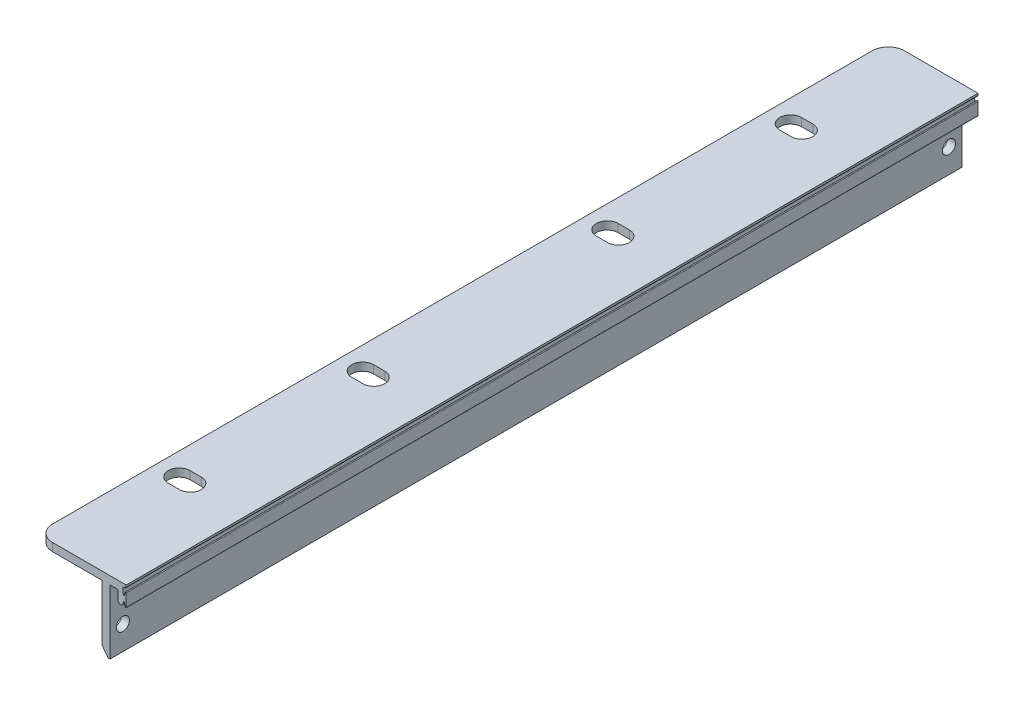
ISO-10303-21;
HEADER;
FILE_DESCRIPTION(('STEP AP214'),'2;1');
FILE_NAME('part.step','',(''),(''),'','','');
FILE_SCHEMA(('AUTOMOTIVE_DESIGN { 1 0 10303 214 1 1 1 1 }'));
ENDSEC;
DATA;
#1=APPLICATION_CONTEXT('core data for automotive mechanical design processes');
#2=APPLICATION_PROTOCOL_DEFINITION('international standard','automotive_design',2000,#1);
#3=PRODUCT_CONTEXT('',#1,'mechanical');
#4=PRODUCT('Part','Part','',(#3));
#5=PRODUCT_RELATED_PRODUCT_CATEGORY('part','',(#4));
#6=PRODUCT_DEFINITION_FORMATION('','',#4);
#7=PRODUCT_DEFINITION_CONTEXT('part definition',#1,'design');
#8=PRODUCT_DEFINITION('design','',#6,#7);
#9=PRODUCT_DEFINITION_SHAPE('','',#8);
#10=(LENGTH_UNIT() NAMED_UNIT(*) SI_UNIT(.MILLI.,.METRE.));
#11=(NAMED_UNIT(*) PLANE_ANGLE_UNIT() SI_UNIT($,.RADIAN.));
#12=(NAMED_UNIT(*) SI_UNIT($,.STERADIAN.) SOLID_ANGLE_UNIT());
#13=UNCERTAINTY_MEASURE_WITH_UNIT(LENGTH_MEASURE(1.E-05),#10,'distance_accuracy_value','');
#14=(GEOMETRIC_REPRESENTATION_CONTEXT(3) GLOBAL_UNCERTAINTY_ASSIGNED_CONTEXT((#13)) GLOBAL_UNIT_ASSIGNED_CONTEXT((#10,
#11,#12)) REPRESENTATION_CONTEXT('',''));
#15=CARTESIAN_POINT('',(0.,0.,0.));
#16=DIRECTION('',(0.,0.,1.));
#17=DIRECTION('',(1.,0.,0.));
#18=AXIS2_PLACEMENT_3D('',#15,#16,#17);
#19=CARTESIAN_POINT('',(2329.98403514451,-3290.10376988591,132.675));
#20=DIRECTION('',(1.,0.,0.));
#21=DIRECTION('',(0.,0.,-1.));
#22=AXIS2_PLACEMENT_3D('',#19,#20,#21);
#23=PLANE('',#22);
#24=DIRECTION('',(0.,0.,-1.));
#25=VECTOR('',#24,1.);
#26=CARTESIAN_POINT('',(2329.98403514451,-3290.10376988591,132.675));
#27=LINE('',#26,#25);
#28=CARTESIAN_POINT('',(2329.98403514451,-3290.10376988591,127.675));
#29=VERTEX_POINT('',#28);
#30=CARTESIAN_POINT('',(2329.98403514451,-3290.10376988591,-127.675));
#31=VERTEX_POINT('',#30);
#32=EDGE_CURVE('E490',#29,#31,#27,.T.);
#33=ORIENTED_EDGE('',*,*,#32,.T.);
#34=DIRECTION('',(0.,-1.,0.));
#35=VECTOR('',#34,1.);
#36=CARTESIAN_POINT('',(2329.98403514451,-3290.10376988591,-127.675));
#37=LINE('',#36,#35);
#38=CARTESIAN_POINT('',(2329.98403514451,-3292.60376988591,-127.675));
#39=VERTEX_POINT('',#38);
#40=EDGE_CURVE('E611',#31,#39,#37,.T.);
#41=ORIENTED_EDGE('',*,*,#40,.T.);
#42=DIRECTION('',(0.,0.,-1.));
#43=VECTOR('',#42,1.);
#44=CARTESIAN_POINT('',(2329.98403514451,-3292.60376988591,132.675));
#45=LINE('',#44,#43);
#46=CARTESIAN_POINT('',(2329.98403514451,-3292.60376988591,127.675));
#47=VERTEX_POINT('',#46);
#48=EDGE_CURVE('E598',#47,#39,#45,.T.);
#49=ORIENTED_EDGE('',*,*,#48,.F.);
#50=DIRECTION('',(0.,-1.,0.));
#51=VECTOR('',#50,1.);
#52=CARTESIAN_POINT('',(2329.98403514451,-3290.10376988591,127.675));
#53=LINE('',#52,#51);
#54=EDGE_CURVE('E601',#47,#29,#53,.F.);
#55=ORIENTED_EDGE('',*,*,#54,.T.);
#56=EDGE_LOOP('',(#33,#41,#49,#55));
#57=FACE_BOUND('',#56,.T.);
#58=ADVANCED_FACE('F37',(#57),#23,.F.);
#59=CARTESIAN_POINT('',(2329.98403514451,-3292.60376988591,132.675));
#60=DIRECTION('',(0.,1.,0.));
#61=DIRECTION('',(0.,0.,1.));
#62=AXIS2_PLACEMENT_3D('',#59,#60,#61);
#63=PLANE('',#62);
#64=DIRECTION('',(-1.,0.,0.));
#65=VECTOR('',#64,1.);
#66=CARTESIAN_POINT('',(2329.98403514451,-3292.60376988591,34.7000000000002));
#67=LINE('',#66,#65);
#68=CARTESIAN_POINT('',(2340.48403514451,-3292.60376988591,34.7000000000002));
#69=VERTEX_POINT('',#68);
#70=CARTESIAN_POINT('',(2336.98403514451,-3292.60376988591,34.7000000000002));
#71=VERTEX_POINT('',#70);
#72=EDGE_CURVE('E342',#69,#71,#67,.T.);
#73=ORIENTED_EDGE('',*,*,#72,.T.);
#74=CARTESIAN_POINT('',(2336.98403514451,-3292.60376988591,38.1));
#75=DIRECTION('',(0.,1.,0.));
#76=DIRECTION('',(0.,0.,1.));
#77=AXIS2_PLACEMENT_3D('',#74,#75,#76);
#78=CIRCLE('',#77,3.39999999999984);
#79=CARTESIAN_POINT('',(2336.98403514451,-3292.60376988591,41.4999999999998));
#80=VERTEX_POINT('',#79);
#81=EDGE_CURVE('E345',#71,#80,#78,.T.);
#82=ORIENTED_EDGE('',*,*,#81,.T.);
#83=DIRECTION('',(1.,0.,0.));
#84=VECTOR('',#83,1.);
#85=CARTESIAN_POINT('',(2329.98403514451,-3292.60376988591,41.4999999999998));
#86=LINE('',#85,#84);
#87=CARTESIAN_POINT('',(2340.48403514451,-3292.60376988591,41.4999999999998));
#88=VERTEX_POINT('',#87);
#89=EDGE_CURVE('E337',#80,#88,#86,.T.);
#90=ORIENTED_EDGE('',*,*,#89,.T.);
#91=CARTESIAN_POINT('',(2340.48403514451,-3292.60376988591,38.1));
#92=DIRECTION('',(0.,1.,0.));
#93=DIRECTION('',(0.,0.,1.));
#94=AXIS2_PLACEMENT_3D('',#91,#92,#93);
#95=CIRCLE('',#94,3.39999999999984);
#96=EDGE_CURVE('E312',#88,#69,#95,.T.);
#97=ORIENTED_EDGE('',*,*,#96,.T.);
#98=EDGE_LOOP('',(#73,#82,#90,#97));
#99=FACE_BOUND('',#98,.T.);
#100=DIRECTION('',(-1.,0.,0.));
#101=VECTOR('',#100,1.);
#102=CARTESIAN_POINT('',(2329.98403514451,-3292.60376988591,-41.4999999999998));
#103=LINE('',#102,#101);
#104=CARTESIAN_POINT('',(2340.48403514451,-3292.60376988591,-41.4999999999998));
#105=VERTEX_POINT('',#104);
#106=CARTESIAN_POINT('',(2336.98403514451,-3292.60376988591,-41.4999999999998));
#107=VERTEX_POINT('',#106);
#108=EDGE_CURVE('E374',#105,#107,#103,.T.);
#109=ORIENTED_EDGE('',*,*,#108,.T.);
#110=CARTESIAN_POINT('',(2336.98403514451,-3292.60376988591,-38.1));
#111=DIRECTION('',(0.,1.,0.));
#112=DIRECTION('',(0.,0.,1.));
#113=AXIS2_PLACEMENT_3D('',#110,#111,#112);
#114=CIRCLE('',#113,3.39999999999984);
#115=CARTESIAN_POINT('',(2336.98403514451,-3292.60376988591,-34.7000000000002));
#116=VERTEX_POINT('',#115);
#117=EDGE_CURVE('E377',#107,#116,#114,.T.);
#118=ORIENTED_EDGE('',*,*,#117,.T.);
#119=DIRECTION('',(1.,0.,0.));
#120=VECTOR('',#119,1.);
#121=CARTESIAN_POINT('',(2329.98403514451,-3292.60376988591,-34.7000000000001));
#122=LINE('',#121,#120);
#123=CARTESIAN_POINT('',(2340.48403514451,-3292.60376988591,-34.7000000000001));
#124=VERTEX_POINT('',#123);
#125=EDGE_CURVE('E362',#116,#124,#122,.T.);
#126=ORIENTED_EDGE('',*,*,#125,.T.);
#127=CARTESIAN_POINT('',(2340.48403514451,-3292.60376988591,-38.1));
#128=DIRECTION('',(0.,1.,0.));
#129=DIRECTION('',(0.,0.,1.));
#130=AXIS2_PLACEMENT_3D('',#127,#128,#129);
#131=CIRCLE('',#130,3.39999999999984);
#132=EDGE_CURVE('E371',#124,#105,#131,.T.);
#133=ORIENTED_EDGE('',*,*,#132,.T.);
#134=EDGE_LOOP('',(#109,#118,#126,#133));
#135=FACE_BOUND('',#134,.T.);
#136=DIRECTION('',(1.,0.,0.));
#137=VECTOR('',#136,1.);
#138=CARTESIAN_POINT('',(2329.98403514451,-3292.60376988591,98.6499999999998));
#139=LINE('',#138,#137);
#140=CARTESIAN_POINT('',(2336.98403514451,-3292.60376988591,98.6499999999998));
#141=VERTEX_POINT('',#140);
#142=CARTESIAN_POINT('',(2340.48403514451,-3292.60376988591,98.6499999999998));
#143=VERTEX_POINT('',#142);
#144=EDGE_CURVE('E406',#141,#143,#139,.T.);
#145=ORIENTED_EDGE('',*,*,#144,.T.);
#146=CARTESIAN_POINT('',(2340.48403514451,-3292.60376988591,95.25));
#147=DIRECTION('',(0.,1.,0.));
#148=DIRECTION('',(0.,0.,1.));
#149=AXIS2_PLACEMENT_3D('',#146,#147,#148);
#150=CIRCLE('',#149,3.39999999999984);
#151=CARTESIAN_POINT('',(2340.48403514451,-3292.60376988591,91.8500000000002));
#152=VERTEX_POINT('',#151);
#153=EDGE_CURVE('E409',#143,#152,#150,.T.);
#154=ORIENTED_EDGE('',*,*,#153,.T.);
#155=DIRECTION('',(-1.,0.,0.));
#156=VECTOR('',#155,1.);
#157=CARTESIAN_POINT('',(2329.98403514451,-3292.60376988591,91.8500000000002));
#158=LINE('',#157,#156);
#159=CARTESIAN_POINT('',(2336.98403514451,-3292.60376988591,91.8500000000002));
#160=VERTEX_POINT('',#159);
#161=EDGE_CURVE('E394',#152,#160,#158,.T.);
#162=ORIENTED_EDGE('',*,*,#161,.T.);
#163=CARTESIAN_POINT('',(2336.98403514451,-3292.60376988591,95.25));
#164=DIRECTION('',(0.,1.,0.));
#165=DIRECTION('',(0.,0.,1.));
#166=AXIS2_PLACEMENT_3D('',#163,#164,#165);
#167=CIRCLE('',#166,3.39999999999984);
#168=EDGE_CURVE('E403',#160,#141,#167,.T.);
#169=ORIENTED_EDGE('',*,*,#168,.T.);
#170=EDGE_LOOP('',(#145,#154,#162,#169));
#171=FACE_BOUND('',#170,.T.);
#172=DIRECTION('',(-1.,0.,0.));
#173=VECTOR('',#172,1.);
#174=CARTESIAN_POINT('',(2329.98403514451,-3292.60376988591,-98.6499999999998));
#175=LINE('',#174,#173);
#176=CARTESIAN_POINT('',(2340.48403514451,-3292.60376988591,-98.6499999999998));
#177=VERTEX_POINT('',#176);
#178=CARTESIAN_POINT('',(2336.98403514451,-3292.60376988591,-98.6499999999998));
#179=VERTEX_POINT('',#178);
#180=EDGE_CURVE('E438',#177,#179,#175,.T.);
#181=ORIENTED_EDGE('',*,*,#180,.T.);
#182=CARTESIAN_POINT('',(2336.98403514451,-3292.60376988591,-95.25));
#183=DIRECTION('',(0.,1.,0.));
#184=DIRECTION('',(0.,0.,1.));
#185=AXIS2_PLACEMENT_3D('',#182,#183,#184);
#186=CIRCLE('',#185,3.39999999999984);
#187=CARTESIAN_POINT('',(2336.98403514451,-3292.60376988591,-91.8500000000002));
#188=VERTEX_POINT('',#187);
#189=EDGE_CURVE('E441',#179,#188,#186,.T.);
#190=ORIENTED_EDGE('',*,*,#189,.T.);
#191=DIRECTION('',(1.,0.,0.));
#192=VECTOR('',#191,1.);
#193=CARTESIAN_POINT('',(2329.98403514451,-3292.60376988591,-91.8500000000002));
#194=LINE('',#193,#192);
#195=CARTESIAN_POINT('',(2340.48403514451,-3292.60376988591,-91.8500000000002));
#196=VERTEX_POINT('',#195);
#197=EDGE_CURVE('E426',#188,#196,#194,.T.);
#198=ORIENTED_EDGE('',*,*,#197,.T.);
#199=CARTESIAN_POINT('',(2340.48403514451,-3292.60376988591,-95.25));
#200=DIRECTION('',(0.,1.,0.));
#201=DIRECTION('',(0.,0.,1.));
#202=AXIS2_PLACEMENT_3D('',#199,#200,#201);
#203=CIRCLE('',#202,3.39999999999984);
#204=EDGE_CURVE('E435',#196,#177,#203,.T.);
#205=ORIENTED_EDGE('',*,*,#204,.T.);
#206=EDGE_LOOP('',(#181,#190,#198,#205));
#207=FACE_BOUND('',#206,.T.);
#208=ORIENTED_EDGE('',*,*,#48,.T.);
#209=CARTESIAN_POINT('',(2334.98403514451,-3292.60376988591,-127.675));
#210=DIRECTION('',(0.,1.,0.));
#211=DIRECTION('',(0.,0.,1.));
#212=AXIS2_PLACEMENT_3D('',#209,#210,#211);
#213=CIRCLE('',#212,5.);
#214=CARTESIAN_POINT('',(2334.98403514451,-3292.60376988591,-132.675));
#215=VERTEX_POINT('',#214);
#216=EDGE_CURVE('E616',#39,#215,#213,.F.);
#217=ORIENTED_EDGE('',*,*,#216,.T.);
#218=DIRECTION('',(1.,0.,0.));
#219=VECTOR('',#218,1.);
#220=CARTESIAN_POINT('',(2329.98403514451,-3292.60376988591,-132.675));
#221=LINE('',#220,#219);
#222=CARTESIAN_POINT('',(2350.3840351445,-3292.60376988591,-132.675));
#223=VERTEX_POINT('',#222);
#224=EDGE_CURVE('E444',#215,#223,#221,.T.);
#225=ORIENTED_EDGE('',*,*,#224,.T.);
#226=DIRECTION('',(0.,0.,-1.));
#227=VECTOR('',#226,1.);
#228=CARTESIAN_POINT('',(2350.3840351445,-3292.60376988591,132.675));
#229=LINE('',#228,#227);
#230=CARTESIAN_POINT('',(2350.3840351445,-3292.60376988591,132.675));
#231=VERTEX_POINT('',#230);
#232=EDGE_CURVE('E595',#231,#223,#229,.T.);
#233=ORIENTED_EDGE('',*,*,#232,.F.);
#234=DIRECTION('',(1.,0.,0.));
#235=VECTOR('',#234,1.);
#236=CARTESIAN_POINT('',(2329.98403514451,-3292.60376988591,132.675));
#237=LINE('',#236,#235);
#238=CARTESIAN_POINT('',(2334.98403514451,-3292.60376988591,132.675));
#239=VERTEX_POINT('',#238);
#240=EDGE_CURVE('E445',#239,#231,#237,.T.);
#241=ORIENTED_EDGE('',*,*,#240,.F.);
#242=CARTESIAN_POINT('',(2334.98403514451,-3292.60376988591,127.675));
#243=DIRECTION('',(0.,1.,0.));
#244=DIRECTION('',(0.,0.,1.));
#245=AXIS2_PLACEMENT_3D('',#242,#243,#244);
#246=CIRCLE('',#245,5.);
#247=EDGE_CURVE('E614',#239,#47,#246,.F.);
#248=ORIENTED_EDGE('',*,*,#247,.T.);
#249=EDGE_LOOP('',(#208,#217,#225,#233,#241,#248));
#250=FACE_BOUND('',#249,.T.);
#251=ADVANCED_FACE('F627',(#99,#135,#171,#207,#250),#63,.F.);
#252=CARTESIAN_POINT('',(2350.3840351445,-3292.60376988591,132.675));
#253=DIRECTION('',(1.,0.,0.));
#254=DIRECTION('',(0.,0.,-1.));
#255=AXIS2_PLACEMENT_3D('',#252,#253,#254);
#256=PLANE('',#255);
#257=CARTESIAN_POINT('',(2350.38403514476,-3305.10376988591,128.675));
#258=DIRECTION('',(-1.,0.,0.));
#259=DIRECTION('',(0.,1.,0.));
#260=AXIS2_PLACEMENT_3D('',#257,#258,#259);
#261=CIRCLE('',#260,2.0499999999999);
#262=CARTESIAN_POINT('',(2350.38403514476,-3307.15376988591,128.675));
#263=VERTEX_POINT('',#262);
#264=EDGE_CURVE('E609',#263,#263,#261,.T.);
#265=ORIENTED_EDGE('',*,*,#264,.F.);
#266=EDGE_LOOP('',(#265));
#267=FACE_BOUND('',#266,.T.);
#268=CARTESIAN_POINT('',(2350.38403514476,-3305.10376988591,-128.675));
#269=DIRECTION('',(-1.,0.,0.));
#270=DIRECTION('',(0.,-1.,0.));
#271=AXIS2_PLACEMENT_3D('',#268,#269,#270);
#272=CIRCLE('',#271,2.0499999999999);
#273=CARTESIAN_POINT('',(2350.38403514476,-3307.15376988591,-128.675));
#274=VERTEX_POINT('',#273);
#275=EDGE_CURVE('E605',#274,#274,#272,.T.);
#276=ORIENTED_EDGE('',*,*,#275,.F.);
#277=EDGE_LOOP('',(#276));
#278=FACE_BOUND('',#277,.T.);
#279=DIRECTION('',(0.,-1.,0.));
#280=VECTOR('',#279,1.);
#281=CARTESIAN_POINT('',(2350.3840351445,-3292.60376988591,-132.675));
#282=LINE('',#281,#280);
#283=CARTESIAN_POINT('',(2350.3840351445,-3310.10376988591,-132.675));
#284=VERTEX_POINT('',#283);
#285=EDGE_CURVE('E492',#223,#284,#282,.T.);
#286=ORIENTED_EDGE('',*,*,#285,.T.);
#287=DIRECTION('',(0.,0.,-1.));
#288=VECTOR('',#287,1.);
#289=CARTESIAN_POINT('',(2350.3840351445,-3310.10376988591,132.675));
#290=LINE('',#289,#288);
#291=CARTESIAN_POINT('',(2350.3840351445,-3310.10376988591,132.675));
#292=VERTEX_POINT('',#291);
#293=EDGE_CURVE('E592',#292,#284,#290,.T.);
#294=ORIENTED_EDGE('',*,*,#293,.F.);
#295=DIRECTION('',(0.,-1.,0.));
#296=VECTOR('',#295,1.);
#297=CARTESIAN_POINT('',(2350.3840351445,-3292.60376988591,132.675));
#298=LINE('',#297,#296);
#299=EDGE_CURVE('E447',#231,#292,#298,.T.);
#300=ORIENTED_EDGE('',*,*,#299,.F.);
#301=ORIENTED_EDGE('',*,*,#232,.T.);
#302=EDGE_LOOP('',(#286,#294,#300,#301));
#303=FACE_BOUND('',#302,.T.);
#304=ADVANCED_FACE('F635',(#267,#278,#303),#256,.F.);
#305=CARTESIAN_POINT('',(2350.3840351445,-3310.10376988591,132.675));
#306=DIRECTION('',(0.796162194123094,0.605083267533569,0.));
#307=DIRECTION('',(-0.605083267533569,0.796162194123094,0.));
#308=AXIS2_PLACEMENT_3D('',#305,#306,#307);
#309=PLANE('',#308);
#310=DIRECTION('',(0.605083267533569,-0.796162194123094,0.));
#311=VECTOR('',#310,1.);
#312=CARTESIAN_POINT('',(2350.3840351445,-3310.10376988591,-132.675));
#313=LINE('',#312,#311);
#314=CARTESIAN_POINT('',(2352.2840351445,-3312.60376988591,-132.675));
#315=VERTEX_POINT('',#314);
#316=EDGE_CURVE('E494',#284,#315,#313,.T.);
#317=ORIENTED_EDGE('',*,*,#316,.T.);
#318=DIRECTION('',(0.,0.,-1.));
#319=VECTOR('',#318,1.);
#320=CARTESIAN_POINT('',(2352.2840351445,-3312.60376988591,132.675));
#321=LINE('',#320,#319);
#322=CARTESIAN_POINT('',(2352.2840351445,-3312.60376988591,132.675));
#323=VERTEX_POINT('',#322);
#324=EDGE_CURVE('E589',#323,#315,#321,.T.);
#325=ORIENTED_EDGE('',*,*,#324,.F.);
#326=DIRECTION('',(0.605083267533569,-0.796162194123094,0.));
#327=VECTOR('',#326,1.);
#328=CARTESIAN_POINT('',(2350.3840351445,-3310.10376988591,132.675));
#329=LINE('',#328,#327);
#330=EDGE_CURVE('E450',#292,#323,#329,.T.);
#331=ORIENTED_EDGE('',*,*,#330,.F.);
#332=ORIENTED_EDGE('',*,*,#293,.T.);
#333=EDGE_LOOP('',(#317,#325,#331,#332));
#334=FACE_BOUND('',#333,.T.);
#335=ADVANCED_FACE('F639',(#334),#309,.F.);
#336=CARTESIAN_POINT('',(2352.8840351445,-3312.60376988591,132.675));
#337=DIRECTION('',(0.,1.,0.));
#338=DIRECTION('',(0.,0.,1.));
#339=AXIS2_PLACEMENT_3D('',#336,#337,#338);
#340=PLANE('',#339);
#341=DIRECTION('',(1.,0.,0.));
#342=VECTOR('',#341,1.);
#343=CARTESIAN_POINT('',(2352.8840351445,-3312.60376988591,-132.675));
#344=LINE('',#343,#342);
#345=CARTESIAN_POINT('',(2352.8840351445,-3312.60376988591,-132.675));
#346=VERTEX_POINT('',#345);
#347=EDGE_CURVE('E496',#315,#346,#344,.T.);
#348=ORIENTED_EDGE('',*,*,#347,.T.);
#349=DIRECTION('',(0.,0.,-1.));
#350=VECTOR('',#349,1.);
#351=CARTESIAN_POINT('',(2352.8840351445,-3312.60376988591,132.675));
#352=LINE('',#351,#350);
#353=CARTESIAN_POINT('',(2352.8840351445,-3312.60376988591,132.675));
#354=VERTEX_POINT('',#353);
#355=EDGE_CURVE('E586',#354,#346,#352,.T.);
#356=ORIENTED_EDGE('',*,*,#355,.F.);
#357=DIRECTION('',(1.,0.,0.));
#358=VECTOR('',#357,1.);
#359=CARTESIAN_POINT('',(2352.8840351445,-3312.60376988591,132.675));
#360=LINE('',#359,#358);
#361=EDGE_CURVE('E452',#323,#354,#360,.T.);
#362=ORIENTED_EDGE('',*,*,#361,.F.);
#363=ORIENTED_EDGE('',*,*,#324,.T.);
#364=EDGE_LOOP('',(#348,#356,#362,#363));
#365=FACE_BOUND('',#364,.T.);
#366=ADVANCED_FACE('F666',(#365),#340,.F.);
#367=CARTESIAN_POINT('',(2352.88403514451,-3292.60376988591,132.675));
#368=DIRECTION('',(-1.,0.,0.));
#369=DIRECTION('',(0.,-1.,0.));
#370=AXIS2_PLACEMENT_3D('',#367,#368,#369);
#371=PLANE('',#370);
#372=CARTESIAN_POINT('',(2352.88403514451,-3305.10376988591,128.675));
#373=DIRECTION('',(-1.,0.,0.));
#374=DIRECTION('',(0.,-1.,0.));
#375=AXIS2_PLACEMENT_3D('',#372,#373,#374);
#376=CIRCLE('',#375,2.0499999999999);
#377=CARTESIAN_POINT('',(2352.88403514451,-3307.15376988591,128.675));
#378=VERTEX_POINT('',#377);
#379=EDGE_CURVE('E606',#378,#378,#376,.T.);
#380=ORIENTED_EDGE('',*,*,#379,.T.);
#381=EDGE_LOOP('',(#380));
#382=FACE_BOUND('',#381,.T.);
#383=CARTESIAN_POINT('',(2352.88403514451,-3305.10376988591,-128.675));
#384=DIRECTION('',(-1.,0.,0.));
#385=DIRECTION('',(0.,-1.,0.));
#386=AXIS2_PLACEMENT_3D('',#383,#384,#385);
#387=CIRCLE('',#386,2.0499999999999);
#388=CARTESIAN_POINT('',(2352.88403514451,-3307.15376988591,-128.675));
#389=VERTEX_POINT('',#388);
#390=EDGE_CURVE('E602',#389,#389,#387,.T.);
#391=ORIENTED_EDGE('',*,*,#390,.T.);
#392=EDGE_LOOP('',(#391));
#393=FACE_BOUND('',#392,.T.);
#394=DIRECTION('',(0.,1.,0.));
#395=VECTOR('',#394,1.);
#396=CARTESIAN_POINT('',(2352.88403514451,-3292.60376988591,-132.675));
#397=LINE('',#396,#395);
#398=CARTESIAN_POINT('',(2352.88403514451,-3292.60376988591,-132.675));
#399=VERTEX_POINT('',#398);
#400=EDGE_CURVE('E498',#346,#399,#397,.T.);
#401=ORIENTED_EDGE('',*,*,#400,.T.);
#402=DIRECTION('',(0.,0.,-1.));
#403=VECTOR('',#402,1.);
#404=CARTESIAN_POINT('',(2352.88403514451,-3292.60376988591,132.675));
#405=LINE('',#404,#403);
#406=CARTESIAN_POINT('',(2352.88403514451,-3292.60376988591,132.675));
#407=VERTEX_POINT('',#406);
#408=EDGE_CURVE('E583',#407,#399,#405,.T.);
#409=ORIENTED_EDGE('',*,*,#408,.F.);
#410=DIRECTION('',(0.,1.,0.));
#411=VECTOR('',#410,1.);
#412=CARTESIAN_POINT('',(2352.88403514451,-3292.60376988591,132.675));
#413=LINE('',#412,#411);
#414=EDGE_CURVE('E454',#354,#407,#413,.T.);
#415=ORIENTED_EDGE('',*,*,#414,.F.);
#416=ORIENTED_EDGE('',*,*,#355,.T.);
#417=EDGE_LOOP('',(#401,#409,#415,#416));
#418=FACE_BOUND('',#417,.T.);
#419=ADVANCED_FACE('F669',(#382,#393,#418),#371,.F.);
#420=CARTESIAN_POINT('',(2352.88403514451,-3292.60376988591,132.675));
#421=DIRECTION('',(3.55271367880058E-13,1.,0.));
#422=DIRECTION('',(-1.,3.55271367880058E-13,0.));
#423=AXIS2_PLACEMENT_3D('',#420,#421,#422);
#424=PLANE('',#423);
#425=DIRECTION('',(1.,-3.55271367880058E-13,0.));
#426=VECTOR('',#425,1.);
#427=CARTESIAN_POINT('',(2352.88403514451,-3292.60376988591,-132.675));
#428=LINE('',#427,#426);
#429=CARTESIAN_POINT('',(2355.38403514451,-3292.60376988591,-132.675));
#430=VERTEX_POINT('',#429);
#431=EDGE_CURVE('E500',#399,#430,#428,.T.);
#432=ORIENTED_EDGE('',*,*,#431,.T.);
#433=DIRECTION('',(0.,0.,-1.));
#434=VECTOR('',#433,1.);
#435=CARTESIAN_POINT('',(2355.38403514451,-3292.60376988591,132.675));
#436=LINE('',#435,#434);
#437=CARTESIAN_POINT('',(2355.38403514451,-3292.60376988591,132.675));
#438=VERTEX_POINT('',#437);
#439=EDGE_CURVE('E580',#438,#430,#436,.T.);
#440=ORIENTED_EDGE('',*,*,#439,.F.);
#441=DIRECTION('',(1.,-3.55271367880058E-13,0.));
#442=VECTOR('',#441,1.);
#443=CARTESIAN_POINT('',(2352.88403514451,-3292.60376988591,132.675));
#444=LINE('',#443,#442);
#445=EDGE_CURVE('E456',#407,#438,#444,.T.);
#446=ORIENTED_EDGE('',*,*,#445,.F.);
#447=ORIENTED_EDGE('',*,*,#408,.T.);
#448=EDGE_LOOP('',(#432,#440,#446,#447));
#449=FACE_BOUND('',#448,.T.);
#450=ADVANCED_FACE('F673',(#449),#424,.F.);
#451=CARTESIAN_POINT('',(2355.38403514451,-3292.60376988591,132.675));
#452=DIRECTION('',(1.,4.56766335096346E-13,0.));
#453=DIRECTION('',(-4.56766335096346E-13,1.,0.));
#454=AXIS2_PLACEMENT_3D('',#451,#452,#453);
#455=PLANE('',#454);
#456=DIRECTION('',(4.56766335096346E-13,-1.,0.));
#457=VECTOR('',#456,1.);
#458=CARTESIAN_POINT('',(2355.38403514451,-3292.60376988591,-132.675));
#459=LINE('',#458,#457);
#460=CARTESIAN_POINT('',(2355.38403514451,-3295.52050767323,-132.675));
#461=VERTEX_POINT('',#460);
#462=EDGE_CURVE('E502',#430,#461,#459,.T.);
#463=ORIENTED_EDGE('',*,*,#462,.T.);
#464=DIRECTION('',(0.,0.,-1.));
#465=VECTOR('',#464,1.);
#466=CARTESIAN_POINT('',(2355.38403514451,-3295.52050767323,132.675));
#467=LINE('',#466,#465);
#468=CARTESIAN_POINT('',(2355.38403514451,-3295.52050767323,132.675));
#469=VERTEX_POINT('',#468);
#470=EDGE_CURVE('E577',#469,#461,#467,.T.);
#471=ORIENTED_EDGE('',*,*,#470,.F.);
#472=DIRECTION('',(4.56766335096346E-13,-1.,0.));
#473=VECTOR('',#472,1.);
#474=CARTESIAN_POINT('',(2355.38403514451,-3292.60376988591,132.675));
#475=LINE('',#474,#473);
#476=EDGE_CURVE('E458',#438,#469,#475,.T.);
#477=ORIENTED_EDGE('',*,*,#476,.F.);
#478=ORIENTED_EDGE('',*,*,#439,.T.);
#479=EDGE_LOOP('',(#463,#471,#477,#478));
#480=FACE_BOUND('',#479,.T.);
#481=ADVANCED_FACE('F677',(#480),#455,.F.);
#482=CARTESIAN_POINT('',(2356.16707703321,-3295.52050767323,132.675));
#483=DIRECTION('',(0.,0.,-1.));
#484=DIRECTION('',(-1.,0.,0.));
#485=AXIS2_PLACEMENT_3D('',#482,#483,#484);
#486=CYLINDRICAL_SURFACE('',#485,0.783041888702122);
#487=CARTESIAN_POINT('',(2356.16707703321,-3295.52050767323,-132.675));
#488=DIRECTION('',(0.,0.,1.));
#489=DIRECTION('',(1.,0.,0.));
#490=AXIS2_PLACEMENT_3D('',#487,#488,#489);
#491=CIRCLE('',#490,0.783041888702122);
#492=CARTESIAN_POINT('',(2356.93315007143,-3295.68263940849,-132.675));
#493=VERTEX_POINT('',#492);
#494=EDGE_CURVE('E504',#461,#493,#491,.T.);
#495=ORIENTED_EDGE('',*,*,#494,.T.);
#496=DIRECTION('',(0.,0.,-1.));
#497=VECTOR('',#496,1.);
#498=CARTESIAN_POINT('',(2356.93315007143,-3295.68263940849,132.675));
#499=LINE('',#498,#497);
#500=CARTESIAN_POINT('',(2356.93315007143,-3295.68263940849,132.675));
#501=VERTEX_POINT('',#500);
#502=EDGE_CURVE('E574',#501,#493,#499,.T.);
#503=ORIENTED_EDGE('',*,*,#502,.F.);
#504=CARTESIAN_POINT('',(2356.16707703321,-3295.52050767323,132.675));
#505=DIRECTION('',(0.,0.,1.));
#506=DIRECTION('',(1.,0.,0.));
#507=AXIS2_PLACEMENT_3D('',#504,#505,#506);
#508=CIRCLE('',#507,0.783041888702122);
#509=EDGE_CURVE('E460',#469,#501,#508,.T.);
#510=ORIENTED_EDGE('',*,*,#509,.F.);
#511=ORIENTED_EDGE('',*,*,#470,.T.);
#512=EDGE_LOOP('',(#495,#503,#510,#511));
#513=FACE_BOUND('',#512,.T.);
#514=ADVANCED_FACE('F681',(#513),#486,.T.);
#515=CARTESIAN_POINT('',(2356.93315007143,-3295.68263940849,132.675));
#516=DIRECTION('',(-0.978329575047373,0.207053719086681,0.));
#517=DIRECTION('',(-0.207053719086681,-0.978329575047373,0.));
#518=AXIS2_PLACEMENT_3D('',#515,#516,#517);
#519=PLANE('',#518);
#520=DIRECTION('',(0.207053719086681,0.978329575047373,0.));
#521=VECTOR('',#520,1.);
#522=CARTESIAN_POINT('',(2356.93315007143,-3295.68263940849,-132.675));
#523=LINE('',#522,#521);
#524=CARTESIAN_POINT('',(2357.0657770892,-3295.05597626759,-132.675));
#525=VERTEX_POINT('',#524);
#526=EDGE_CURVE('E506',#493,#525,#523,.T.);
#527=ORIENTED_EDGE('',*,*,#526,.T.);
#528=DIRECTION('',(0.,0.,-1.));
#529=VECTOR('',#528,1.);
#530=CARTESIAN_POINT('',(2357.0657770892,-3295.05597626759,132.675));
#531=LINE('',#530,#529);
#532=CARTESIAN_POINT('',(2357.0657770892,-3295.05597626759,132.675));
#533=VERTEX_POINT('',#532);
#534=EDGE_CURVE('E571',#533,#525,#531,.T.);
#535=ORIENTED_EDGE('',*,*,#534,.F.);
#536=DIRECTION('',(0.207053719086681,0.978329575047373,0.));
#537=VECTOR('',#536,1.);
#538=CARTESIAN_POINT('',(2356.93315007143,-3295.68263940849,132.675));
#539=LINE('',#538,#537);
#540=EDGE_CURVE('E462',#501,#533,#539,.T.);
#541=ORIENTED_EDGE('',*,*,#540,.F.);
#542=ORIENTED_EDGE('',*,*,#502,.T.);
#543=EDGE_LOOP('',(#527,#535,#541,#542));
#544=FACE_BOUND('',#543,.T.);
#545=ADVANCED_FACE('F685',(#544),#519,.F.);
#546=CARTESIAN_POINT('',(2357.21403514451,-3295.07876988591,132.675));
#547=DIRECTION('',(0.,0.,-1.));
#548=DIRECTION('',(-1.,0.,0.));
#549=AXIS2_PLACEMENT_3D('',#546,#547,#548);
#550=CYLINDRICAL_SURFACE('',#549,0.149999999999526);
#551=CARTESIAN_POINT('',(2357.21403514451,-3295.07876988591,-132.675));
#552=DIRECTION('',(0.,0.,-1.));
#553=DIRECTION('',(1.,0.,0.));
#554=AXIS2_PLACEMENT_3D('',#551,#552,#553);
#555=CIRCLE('',#554,0.149999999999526);
#556=CARTESIAN_POINT('',(2357.36106233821,-3295.04905449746,-132.675));
#557=VERTEX_POINT('',#556);
#558=EDGE_CURVE('E508',#525,#557,#555,.T.);
#559=ORIENTED_EDGE('',*,*,#558,.T.);
#560=DIRECTION('',(0.,0.,-1.));
#561=VECTOR('',#560,1.);
#562=CARTESIAN_POINT('',(2357.36106233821,-3295.04905449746,132.675));
#563=LINE('',#562,#561);
#564=CARTESIAN_POINT('',(2357.36106233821,-3295.04905449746,132.675));
#565=VERTEX_POINT('',#564);
#566=EDGE_CURVE('E568',#565,#557,#563,.T.);
#567=ORIENTED_EDGE('',*,*,#566,.F.);
#568=CARTESIAN_POINT('',(2357.21403514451,-3295.07876988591,132.675));
#569=DIRECTION('',(0.,0.,-1.));
#570=DIRECTION('',(1.,0.,0.));
#571=AXIS2_PLACEMENT_3D('',#568,#569,#570);
#572=CIRCLE('',#571,0.149999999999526);
#573=EDGE_CURVE('E464',#533,#565,#572,.T.);
#574=ORIENTED_EDGE('',*,*,#573,.F.);
#575=ORIENTED_EDGE('',*,*,#534,.T.);
#576=EDGE_LOOP('',(#559,#567,#574,#575));
#577=FACE_BOUND('',#576,.T.);
#578=ADVANCED_FACE('F689',(#577),#550,.F.);
#579=CARTESIAN_POINT('',(2357.36106233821,-3295.04905449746,132.675));
#580=DIRECTION('',(0.980181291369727,0.198102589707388,0.));
#581=DIRECTION('',(-0.198102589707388,0.980181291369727,0.));
#582=AXIS2_PLACEMENT_3D('',#579,#580,#581);
#583=PLANE('',#582);
#584=DIRECTION('',(0.198102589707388,-0.980181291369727,0.));
#585=VECTOR('',#584,1.);
#586=CARTESIAN_POINT('',(2357.36106233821,-3295.04905449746,-132.675));
#587=LINE('',#586,#585);
#588=CARTESIAN_POINT('',(2357.58727718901,-3296.16833095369,-132.675));
#589=VERTEX_POINT('',#588);
#590=EDGE_CURVE('E510',#557,#589,#587,.T.);
#591=ORIENTED_EDGE('',*,*,#590,.T.);
#592=DIRECTION('',(0.,0.,-1.));
#593=VECTOR('',#592,1.);
#594=CARTESIAN_POINT('',(2357.58727718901,-3296.16833095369,132.675));
#595=LINE('',#594,#593);
#596=CARTESIAN_POINT('',(2357.58727718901,-3296.16833095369,132.675));
#597=VERTEX_POINT('',#596);
#598=EDGE_CURVE('E565',#597,#589,#595,.T.);
#599=ORIENTED_EDGE('',*,*,#598,.F.);
#600=DIRECTION('',(0.198102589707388,-0.980181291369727,0.));
#601=VECTOR('',#600,1.);
#602=CARTESIAN_POINT('',(2357.36106233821,-3295.04905449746,132.675));
#603=LINE('',#602,#601);
#604=EDGE_CURVE('E466',#565,#597,#603,.T.);
#605=ORIENTED_EDGE('',*,*,#604,.F.);
#606=ORIENTED_EDGE('',*,*,#566,.T.);
#607=EDGE_LOOP('',(#591,#599,#605,#606));
#608=FACE_BOUND('',#607,.T.);
#609=ADVANCED_FACE('F693',(#608),#583,.F.);
#610=CARTESIAN_POINT('',(2357.75403514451,-3296.13462781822,132.675));
#611=DIRECTION('',(0.,0.,-1.));
#612=DIRECTION('',(-1.,0.,0.));
#613=AXIS2_PLACEMENT_3D('',#610,#611,#612);
#614=CYLINDRICAL_SURFACE('',#613,0.170129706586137);
#615=CARTESIAN_POINT('',(2357.75403514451,-3296.13462781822,-132.675));
#616=DIRECTION('',(0.,0.,1.));
#617=DIRECTION('',(1.,0.,0.));
#618=AXIS2_PLACEMENT_3D('',#615,#616,#617);
#619=CIRCLE('',#618,0.170129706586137);
#620=CARTESIAN_POINT('',(2357.92403514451,-3296.12798575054,-132.675));
#621=VERTEX_POINT('',#620);
#622=EDGE_CURVE('E512',#589,#621,#619,.T.);
#623=ORIENTED_EDGE('',*,*,#622,.T.);
#624=DIRECTION('',(0.,0.,-1.));
#625=VECTOR('',#624,1.);
#626=CARTESIAN_POINT('',(2357.92403514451,-3296.12798575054,132.675));
#627=LINE('',#626,#625);
#628=CARTESIAN_POINT('',(2357.92403514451,-3296.12798575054,132.675));
#629=VERTEX_POINT('',#628);
#630=EDGE_CURVE('E562',#629,#621,#627,.T.);
#631=ORIENTED_EDGE('',*,*,#630,.F.);
#632=CARTESIAN_POINT('',(2357.75403514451,-3296.13462781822,132.675));
#633=DIRECTION('',(0.,0.,1.));
#634=DIRECTION('',(1.,0.,0.));
#635=AXIS2_PLACEMENT_3D('',#632,#633,#634);
#636=CIRCLE('',#635,0.170129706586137);
#637=EDGE_CURVE('E468',#597,#629,#636,.T.);
#638=ORIENTED_EDGE('',*,*,#637,.F.);
#639=ORIENTED_EDGE('',*,*,#598,.T.);
#640=EDGE_LOOP('',(#623,#631,#638,#639));
#641=FACE_BOUND('',#640,.T.);
#642=ADVANCED_FACE('F697',(#641),#614,.T.);
#643=CARTESIAN_POINT('',(2357.92403514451,-3292.2795540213,132.675));
#644=DIRECTION('',(-1.,0.,0.));
#645=DIRECTION('',(0.,0.,1.));
#646=AXIS2_PLACEMENT_3D('',#643,#644,#645);
#647=PLANE('',#646);
#648=DIRECTION('',(0.,1.,0.));
#649=VECTOR('',#648,1.);
#650=CARTESIAN_POINT('',(2357.92403514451,-3292.2795540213,-132.675));
#651=LINE('',#650,#649);
#652=CARTESIAN_POINT('',(2357.92403514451,-3292.2795540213,-132.675));
#653=VERTEX_POINT('',#652);
#654=EDGE_CURVE('E514',#621,#653,#651,.T.);
#655=ORIENTED_EDGE('',*,*,#654,.T.);
#656=DIRECTION('',(0.,0.,-1.));
#657=VECTOR('',#656,1.);
#658=CARTESIAN_POINT('',(2357.92403514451,-3292.2795540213,132.675));
#659=LINE('',#658,#657);
#660=CARTESIAN_POINT('',(2357.92403514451,-3292.2795540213,132.675));
#661=VERTEX_POINT('',#660);
#662=EDGE_CURVE('E559',#661,#653,#659,.T.);
#663=ORIENTED_EDGE('',*,*,#662,.F.);
#664=DIRECTION('',(0.,1.,0.));
#665=VECTOR('',#664,1.);
#666=CARTESIAN_POINT('',(2357.92403514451,-3292.2795540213,132.675));
#667=LINE('',#666,#665);
#668=EDGE_CURVE('E470',#629,#661,#667,.T.);
#669=ORIENTED_EDGE('',*,*,#668,.F.);
#670=ORIENTED_EDGE('',*,*,#630,.T.);
#671=EDGE_LOOP('',(#655,#663,#669,#670));
#672=FACE_BOUND('',#671,.T.);
#673=ADVANCED_FACE('F701',(#672),#647,.F.);
#674=CARTESIAN_POINT('',(2357.75403514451,-3292.27291195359,132.675));
#675=DIRECTION('',(0.,0.,-1.));
#676=DIRECTION('',(-1.,0.,0.));
#677=AXIS2_PLACEMENT_3D('',#674,#675,#676);
#678=CYLINDRICAL_SURFACE('',#677,0.170129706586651);
#679=CARTESIAN_POINT('',(2357.75403514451,-3292.27291195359,-132.675));
#680=DIRECTION('',(0.,0.,1.));
#681=DIRECTION('',(1.,0.,0.));
#682=AXIS2_PLACEMENT_3D('',#679,#680,#681);
#683=CIRCLE('',#682,0.170129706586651);
#684=CARTESIAN_POINT('',(2357.58835224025,-3292.23426881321,-132.675));
#685=VERTEX_POINT('',#684);
#686=EDGE_CURVE('E516',#653,#685,#683,.T.);
#687=ORIENTED_EDGE('',*,*,#686,.T.);
#688=DIRECTION('',(0.,0.,-1.));
#689=VECTOR('',#688,1.);
#690=CARTESIAN_POINT('',(2357.58835224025,-3292.23426881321,132.675));
#691=LINE('',#690,#689);
#692=CARTESIAN_POINT('',(2357.58835224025,-3292.23426881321,132.675));
#693=VERTEX_POINT('',#692);
#694=EDGE_CURVE('E556',#693,#685,#691,.T.);
#695=ORIENTED_EDGE('',*,*,#694,.F.);
#696=CARTESIAN_POINT('',(2357.75403514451,-3292.27291195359,132.675));
#697=DIRECTION('',(0.,0.,1.));
#698=DIRECTION('',(1.,0.,0.));
#699=AXIS2_PLACEMENT_3D('',#696,#697,#698);
#700=CIRCLE('',#699,0.170129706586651);
#701=EDGE_CURVE('E472',#661,#693,#700,.T.);
#702=ORIENTED_EDGE('',*,*,#701,.F.);
#703=ORIENTED_EDGE('',*,*,#662,.T.);
#704=EDGE_LOOP('',(#687,#695,#702,#703));
#705=FACE_BOUND('',#704,.T.);
#706=ADVANCED_FACE('F705',(#705),#678,.T.);
#707=CARTESIAN_POINT('',(2357.58835224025,-3292.23426881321,132.675));
#708=DIRECTION('',(0.973862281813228,-0.227139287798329,0.));
#709=DIRECTION('',(0.227139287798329,0.973862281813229,0.));
#710=AXIS2_PLACEMENT_3D('',#707,#708,#709);
#711=PLANE('',#710);
#712=DIRECTION('',(-0.227139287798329,-0.973862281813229,0.));
#713=VECTOR('',#712,1.);
#714=CARTESIAN_POINT('',(2357.58835224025,-3292.23426881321,-132.675));
#715=LINE('',#714,#713);
#716=CARTESIAN_POINT('',(2357.36011448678,-3293.21284077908,-132.675));
#717=VERTEX_POINT('',#716);
#718=EDGE_CURVE('E518',#685,#717,#715,.T.);
#719=ORIENTED_EDGE('',*,*,#718,.T.);
#720=DIRECTION('',(0.,0.,-1.));
#721=VECTOR('',#720,1.);
#722=CARTESIAN_POINT('',(2357.36011448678,-3293.21284077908,132.675));
#723=LINE('',#722,#721);
#724=CARTESIAN_POINT('',(2357.36011448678,-3293.21284077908,132.675));
#725=VERTEX_POINT('',#724);
#726=EDGE_CURVE('E553',#725,#717,#723,.T.);
#727=ORIENTED_EDGE('',*,*,#726,.F.);
#728=DIRECTION('',(-0.227139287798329,-0.973862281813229,0.));
#729=VECTOR('',#728,1.);
#730=CARTESIAN_POINT('',(2357.58835224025,-3292.23426881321,132.675));
#731=LINE('',#730,#729);
#732=EDGE_CURVE('E474',#693,#725,#731,.T.);
#733=ORIENTED_EDGE('',*,*,#732,.F.);
#734=ORIENTED_EDGE('',*,*,#694,.T.);
#735=EDGE_LOOP('',(#719,#727,#733,#734));
#736=FACE_BOUND('',#735,.T.);
#737=ADVANCED_FACE('F709',(#736),#711,.F.);
#738=CARTESIAN_POINT('',(2357.21403514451,-3293.17876988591,132.675));
#739=DIRECTION('',(0.,0.,-1.));
#740=DIRECTION('',(-1.,0.,0.));
#741=AXIS2_PLACEMENT_3D('',#738,#739,#740);
#742=CYLINDRICAL_SURFACE('',#741,0.149999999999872);
#743=CARTESIAN_POINT('',(2357.21403514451,-3293.17876988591,-132.675));
#744=DIRECTION('',(0.,0.,-1.));
#745=DIRECTION('',(1.,0.,0.));
#746=AXIS2_PLACEMENT_3D('',#743,#744,#745);
#747=CIRCLE('',#746,0.149999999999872);
#748=CARTESIAN_POINT('',(2357.06505879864,-3293.19626412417,-132.675));
#749=VERTEX_POINT('',#748);
#750=EDGE_CURVE('E520',#717,#749,#747,.T.);
#751=ORIENTED_EDGE('',*,*,#750,.T.);
#752=DIRECTION('',(0.,0.,-1.));
#753=VECTOR('',#752,1.);
#754=CARTESIAN_POINT('',(2357.06505879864,-3293.19626412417,132.675));
#755=LINE('',#754,#753);
#756=CARTESIAN_POINT('',(2357.06505879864,-3293.19626412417,132.675));
#757=VERTEX_POINT('',#756);
#758=EDGE_CURVE('E550',#757,#749,#755,.T.);
#759=ORIENTED_EDGE('',*,*,#758,.F.);
#760=CARTESIAN_POINT('',(2357.21403514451,-3293.17876988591,132.675));
#761=DIRECTION('',(0.,0.,-1.));
#762=DIRECTION('',(1.,0.,0.));
#763=AXIS2_PLACEMENT_3D('',#760,#761,#762);
#764=CIRCLE('',#763,0.149999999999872);
#765=EDGE_CURVE('E476',#725,#757,#764,.T.);
#766=ORIENTED_EDGE('',*,*,#765,.F.);
#767=ORIENTED_EDGE('',*,*,#726,.T.);
#768=EDGE_LOOP('',(#751,#759,#766,#767));
#769=FACE_BOUND('',#768,.T.);
#770=ADVANCED_FACE('F713',(#769),#742,.F.);
#771=CARTESIAN_POINT('',(2363.3121199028,-3291.606294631,132.675));
#772=DIRECTION('',(0.,0.,-1.));
#773=DIRECTION('',(-1.,0.,0.));
#774=AXIS2_PLACEMENT_3D('',#771,#772,#773);
#775=CYLINDRICAL_SURFACE('',#774,6.44622179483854);
#776=CARTESIAN_POINT('',(2363.3121199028,-3291.606294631,-132.675));
#777=DIRECTION('',(0.,0.,-1.));
#778=DIRECTION('',(1.,0.,0.));
#779=AXIS2_PLACEMENT_3D('',#776,#777,#778);
#780=CIRCLE('',#779,6.44622179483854);
#781=CARTESIAN_POINT('',(2356.87109185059,-3291.34758038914,-132.675));
#782=VERTEX_POINT('',#781);
#783=EDGE_CURVE('E522',#749,#782,#780,.T.);
#784=ORIENTED_EDGE('',*,*,#783,.T.);
#785=DIRECTION('',(0.,0.,-1.));
#786=VECTOR('',#785,1.);
#787=CARTESIAN_POINT('',(2356.87109185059,-3291.34758038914,132.675));
#788=LINE('',#787,#786);
#789=CARTESIAN_POINT('',(2356.87109185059,-3291.34758038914,132.675));
#790=VERTEX_POINT('',#789);
#791=EDGE_CURVE('E547',#790,#782,#788,.T.);
#792=ORIENTED_EDGE('',*,*,#791,.F.);
#793=CARTESIAN_POINT('',(2363.3121199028,-3291.606294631,132.675));
#794=DIRECTION('',(0.,0.,-1.));
#795=DIRECTION('',(1.,0.,0.));
#796=AXIS2_PLACEMENT_3D('',#793,#794,#795);
#797=CIRCLE('',#796,6.44622179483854);
#798=EDGE_CURVE('E478',#757,#790,#797,.T.);
#799=ORIENTED_EDGE('',*,*,#798,.F.);
#800=ORIENTED_EDGE('',*,*,#758,.T.);
#801=EDGE_LOOP('',(#784,#792,#799,#800));
#802=FACE_BOUND('',#801,.T.);
#803=ADVANCED_FACE('F717',(#802),#775,.F.);
#804=CARTESIAN_POINT('',(2357.17085013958,-3291.35962066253,132.675));
#805=DIRECTION('',(0.,0.,-1.));
#806=DIRECTION('',(-1.,0.,0.));
#807=AXIS2_PLACEMENT_3D('',#804,#805,#806);
#808=CYLINDRICAL_SURFACE('',#807,0.29999999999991);
#809=CARTESIAN_POINT('',(2357.17085013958,-3291.35962066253,-132.675));
#810=DIRECTION('',(0.,0.,-1.));
#811=DIRECTION('',(1.,0.,0.));
#812=AXIS2_PLACEMENT_3D('',#809,#810,#811);
#813=CIRCLE('',#812,0.29999999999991);
#814=CARTESIAN_POINT('',(2357.12290306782,-3291.06347698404,-132.675));
#815=VERTEX_POINT('',#814);
#816=EDGE_CURVE('E524',#782,#815,#813,.T.);
#817=ORIENTED_EDGE('',*,*,#816,.T.);
#818=DIRECTION('',(0.,0.,-1.));
#819=VECTOR('',#818,1.);
#820=CARTESIAN_POINT('',(2357.12290306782,-3291.06347698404,132.675));
#821=LINE('',#820,#819);
#822=CARTESIAN_POINT('',(2357.12290306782,-3291.06347698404,132.675));
#823=VERTEX_POINT('',#822);
#824=EDGE_CURVE('E544',#823,#815,#821,.T.);
#825=ORIENTED_EDGE('',*,*,#824,.F.);
#826=CARTESIAN_POINT('',(2357.17085013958,-3291.35962066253,132.675));
#827=DIRECTION('',(0.,0.,-1.));
#828=DIRECTION('',(1.,0.,0.));
#829=AXIS2_PLACEMENT_3D('',#826,#827,#828);
#830=CIRCLE('',#829,0.29999999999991);
#831=EDGE_CURVE('E480',#790,#823,#830,.T.);
#832=ORIENTED_EDGE('',*,*,#831,.F.);
#833=ORIENTED_EDGE('',*,*,#791,.T.);
#834=EDGE_LOOP('',(#817,#825,#832,#833));
#835=FACE_BOUND('',#834,.T.);
#836=ADVANCED_FACE('F721',(#835),#808,.F.);
#837=CARTESIAN_POINT('',(2357.12290306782,-3291.06347698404,132.675));
#838=DIRECTION('',(-0.15982357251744,0.987145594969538,0.));
#839=DIRECTION('',(-0.987145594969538,-0.15982357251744,0.));
#840=AXIS2_PLACEMENT_3D('',#837,#838,#839);
#841=PLANE('',#840);
#842=DIRECTION('',(0.987145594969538,0.15982357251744,0.));
#843=VECTOR('',#842,1.);
#844=CARTESIAN_POINT('',(2357.12290306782,-3291.06347698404,-132.675));
#845=LINE('',#844,#843);
#846=CARTESIAN_POINT('',(2357.67198221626,-3290.97457845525,-132.675));
#847=VERTEX_POINT('',#846);
#848=EDGE_CURVE('E526',#815,#847,#845,.T.);
#849=ORIENTED_EDGE('',*,*,#848,.T.);
#850=DIRECTION('',(0.,0.,-1.));
#851=VECTOR('',#850,1.);
#852=CARTESIAN_POINT('',(2357.67198221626,-3290.97457845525,132.675));
#853=LINE('',#852,#851);
#854=CARTESIAN_POINT('',(2357.67198221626,-3290.97457845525,132.675));
#855=VERTEX_POINT('',#854);
#856=EDGE_CURVE('E541',#855,#847,#853,.T.);
#857=ORIENTED_EDGE('',*,*,#856,.F.);
#858=DIRECTION('',(0.987145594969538,0.15982357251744,0.));
#859=VECTOR('',#858,1.);
#860=CARTESIAN_POINT('',(2357.12290306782,-3291.06347698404,132.675));
#861=LINE('',#860,#859);
#862=EDGE_CURVE('E482',#823,#855,#861,.T.);
#863=ORIENTED_EDGE('',*,*,#862,.F.);
#864=ORIENTED_EDGE('',*,*,#824,.T.);
#865=EDGE_LOOP('',(#849,#857,#863,#864));
#866=FACE_BOUND('',#865,.T.);
#867=ADVANCED_FACE('F725',(#866),#841,.F.);
#868=CARTESIAN_POINT('',(2357.62403514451,-3290.67843477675,132.675));
#869=DIRECTION('',(0.,0.,-1.));
#870=DIRECTION('',(-1.,0.,0.));
#871=AXIS2_PLACEMENT_3D('',#868,#869,#870);
#872=CYLINDRICAL_SURFACE('',#871,0.300000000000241);
#873=CARTESIAN_POINT('',(2357.62403514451,-3290.67843477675,-132.675));
#874=DIRECTION('',(0.,0.,1.));
#875=DIRECTION('',(1.,0.,0.));
#876=AXIS2_PLACEMENT_3D('',#873,#874,#875);
#877=CIRCLE('',#876,0.300000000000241);
#878=CARTESIAN_POINT('',(2357.92403514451,-3290.67843477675,-132.675));
#879=VERTEX_POINT('',#878);
#880=EDGE_CURVE('E528',#847,#879,#877,.T.);
#881=ORIENTED_EDGE('',*,*,#880,.T.);
#882=DIRECTION('',(0.,0.,-1.));
#883=VECTOR('',#882,1.);
#884=CARTESIAN_POINT('',(2357.92403514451,-3290.67843477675,132.675));
#885=LINE('',#884,#883);
#886=CARTESIAN_POINT('',(2357.92403514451,-3290.67843477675,132.675));
#887=VERTEX_POINT('',#886);
#888=EDGE_CURVE('E538',#887,#879,#885,.T.);
#889=ORIENTED_EDGE('',*,*,#888,.F.);
#890=CARTESIAN_POINT('',(2357.62403514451,-3290.67843477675,132.675));
#891=DIRECTION('',(0.,0.,1.));
#892=DIRECTION('',(1.,0.,0.));
#893=AXIS2_PLACEMENT_3D('',#890,#891,#892);
#894=CIRCLE('',#893,0.300000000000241);
#895=EDGE_CURVE('E484',#855,#887,#894,.T.);
#896=ORIENTED_EDGE('',*,*,#895,.F.);
#897=ORIENTED_EDGE('',*,*,#856,.T.);
#898=EDGE_LOOP('',(#881,#889,#896,#897));
#899=FACE_BOUND('',#898,.T.);
#900=ADVANCED_FACE('F729',(#899),#872,.T.);
#901=CARTESIAN_POINT('',(2357.92403514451,-3290.10376988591,132.675));
#902=DIRECTION('',(-1.,1.54555887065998E-12,0.));
#903=DIRECTION('',(-1.54555887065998E-12,-1.,0.));
#904=AXIS2_PLACEMENT_3D('',#901,#902,#903);
#905=PLANE('',#904);
#906=DIRECTION('',(1.54555887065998E-12,1.,0.));
#907=VECTOR('',#906,1.);
#908=CARTESIAN_POINT('',(2357.92403514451,-3290.10376988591,-132.675));
#909=LINE('',#908,#907);
#910=CARTESIAN_POINT('',(2357.92403514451,-3290.10376988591,-132.675));
#911=VERTEX_POINT('',#910);
#912=EDGE_CURVE('E530',#879,#911,#909,.T.);
#913=ORIENTED_EDGE('',*,*,#912,.T.);
#914=DIRECTION('',(0.,0.,-1.));
#915=VECTOR('',#914,1.);
#916=CARTESIAN_POINT('',(2357.92403514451,-3290.10376988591,132.675));
#917=LINE('',#916,#915);
#918=CARTESIAN_POINT('',(2357.92403514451,-3290.10376988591,132.675));
#919=VERTEX_POINT('',#918);
#920=EDGE_CURVE('E535',#919,#911,#917,.T.);
#921=ORIENTED_EDGE('',*,*,#920,.F.);
#922=DIRECTION('',(1.54555887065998E-12,1.,0.));
#923=VECTOR('',#922,1.);
#924=CARTESIAN_POINT('',(2357.92403514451,-3290.10376988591,132.675));
#925=LINE('',#924,#923);
#926=EDGE_CURVE('E486',#887,#919,#925,.T.);
#927=ORIENTED_EDGE('',*,*,#926,.F.);
#928=ORIENTED_EDGE('',*,*,#888,.T.);
#929=EDGE_LOOP('',(#913,#921,#927,#928));
#930=FACE_BOUND('',#929,.T.);
#931=ADVANCED_FACE('F733',(#930),#905,.F.);
#932=CARTESIAN_POINT('',(2329.98403514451,-3290.10376988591,132.675));
#933=DIRECTION('',(0.,-1.,0.));
#934=DIRECTION('',(1.,0.,0.));
#935=AXIS2_PLACEMENT_3D('',#932,#933,#934);
#936=PLANE('',#935);
#937=DIRECTION('',(1.,0.,0.));
#938=VECTOR('',#937,1.);
#939=CARTESIAN_POINT('',(2340.48403514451,-3290.10376988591,41.4999999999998));
#940=LINE('',#939,#938);
#941=CARTESIAN_POINT('',(2336.98403514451,-3290.10376988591,41.4999999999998));
#942=VERTEX_POINT('',#941);
#943=CARTESIAN_POINT('',(2340.48403514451,-3290.10376988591,41.4999999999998));
#944=VERTEX_POINT('',#943);
#945=EDGE_CURVE('E320',#942,#944,#940,.T.);
#946=ORIENTED_EDGE('',*,*,#945,.F.);
#947=CARTESIAN_POINT('',(2336.98403514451,-3290.10376988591,38.1));
#948=DIRECTION('',(0.,1.,0.));
#949=DIRECTION('',(-1.,0.,0.));
#950=AXIS2_PLACEMENT_3D('',#947,#948,#949);
#951=CIRCLE('',#950,3.39999999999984);
#952=CARTESIAN_POINT('',(2336.98403514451,-3290.10376988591,34.7000000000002));
#953=VERTEX_POINT('',#952);
#954=EDGE_CURVE('E325',#953,#942,#951,.T.);
#955=ORIENTED_EDGE('',*,*,#954,.F.);
#956=DIRECTION('',(-1.,0.,0.));
#957=VECTOR('',#956,1.);
#958=CARTESIAN_POINT('',(2340.48403514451,-3290.10376988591,34.7000000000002));
#959=LINE('',#958,#957);
#960=CARTESIAN_POINT('',(2340.48403514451,-3290.10376988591,34.7000000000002));
#961=VERTEX_POINT('',#960);
#962=EDGE_CURVE('E330',#961,#953,#959,.T.);
#963=ORIENTED_EDGE('',*,*,#962,.F.);
#964=CARTESIAN_POINT('',(2340.48403514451,-3290.10376988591,38.1));
#965=DIRECTION('',(0.,1.,0.));
#966=DIRECTION('',(-1.,0.,0.));
#967=AXIS2_PLACEMENT_3D('',#964,#965,#966);
#968=CIRCLE('',#967,3.39999999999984);
#969=EDGE_CURVE('E309',#944,#961,#968,.T.);
#970=ORIENTED_EDGE('',*,*,#969,.F.);
#971=EDGE_LOOP('',(#946,#955,#963,#970));
#972=FACE_BOUND('',#971,.T.);
#973=DIRECTION('',(1.,0.,0.));
#974=VECTOR('',#973,1.);
#975=CARTESIAN_POINT('',(2340.48403514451,-3290.10376988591,-34.7000000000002));
#976=LINE('',#975,#974);
#977=CARTESIAN_POINT('',(2336.98403514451,-3290.10376988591,-34.7000000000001));
#978=VERTEX_POINT('',#977);
#979=CARTESIAN_POINT('',(2340.48403514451,-3290.10376988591,-34.7000000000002));
#980=VERTEX_POINT('',#979);
#981=EDGE_CURVE('E350',#978,#980,#976,.T.);
#982=ORIENTED_EDGE('',*,*,#981,.F.);
#983=CARTESIAN_POINT('',(2336.98403514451,-3290.10376988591,-38.1));
#984=DIRECTION('',(0.,1.,0.));
#985=DIRECTION('',(-1.,0.,0.));
#986=AXIS2_PLACEMENT_3D('',#983,#984,#985);
#987=CIRCLE('',#986,3.39999999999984);
#988=CARTESIAN_POINT('',(2336.98403514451,-3290.10376988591,-41.4999999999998));
#989=VERTEX_POINT('',#988);
#990=EDGE_CURVE('E348',#989,#978,#987,.T.);
#991=ORIENTED_EDGE('',*,*,#990,.F.);
#992=DIRECTION('',(-1.,0.,0.));
#993=VECTOR('',#992,1.);
#994=CARTESIAN_POINT('',(2340.48403514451,-3290.10376988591,-41.4999999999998));
#995=LINE('',#994,#993);
#996=CARTESIAN_POINT('',(2340.48403514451,-3290.10376988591,-41.4999999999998));
#997=VERTEX_POINT('',#996);
#998=EDGE_CURVE('E356',#997,#989,#995,.T.);
#999=ORIENTED_EDGE('',*,*,#998,.F.);
#1000=CARTESIAN_POINT('',(2340.48403514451,-3290.10376988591,-38.1));
#1001=DIRECTION('',(0.,1.,0.));
#1002=DIRECTION('',(-1.,0.,0.));
#1003=AXIS2_PLACEMENT_3D('',#1000,#1001,#1002);
#1004=CIRCLE('',#1003,3.39999999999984);
#1005=EDGE_CURVE('E353',#980,#997,#1004,.T.);
#1006=ORIENTED_EDGE('',*,*,#1005,.F.);
#1007=EDGE_LOOP('',(#982,#991,#999,#1006));
#1008=FACE_BOUND('',#1007,.T.);
#1009=DIRECTION('',(-1.,0.,0.));
#1010=VECTOR('',#1009,1.);
#1011=CARTESIAN_POINT('',(2340.48403514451,-3290.10376988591,91.8500000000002));
#1012=LINE('',#1011,#1010);
#1013=CARTESIAN_POINT('',(2340.48403514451,-3290.10376988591,91.8500000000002));
#1014=VERTEX_POINT('',#1013);
#1015=CARTESIAN_POINT('',(2336.98403514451,-3290.10376988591,91.8500000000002));
#1016=VERTEX_POINT('',#1015);
#1017=EDGE_CURVE('E382',#1014,#1016,#1012,.T.);
#1018=ORIENTED_EDGE('',*,*,#1017,.F.);
#1019=CARTESIAN_POINT('',(2340.48403514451,-3290.10376988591,95.25));
#1020=DIRECTION('',(0.,1.,0.));
#1021=DIRECTION('',(1.,0.,0.));
#1022=AXIS2_PLACEMENT_3D('',#1019,#1020,#1021);
#1023=CIRCLE('',#1022,3.39999999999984);
#1024=CARTESIAN_POINT('',(2340.48403514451,-3290.10376988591,98.6499999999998));
#1025=VERTEX_POINT('',#1024);
#1026=EDGE_CURVE('E380',#1025,#1014,#1023,.T.);
#1027=ORIENTED_EDGE('',*,*,#1026,.F.);
#1028=DIRECTION('',(1.,0.,0.));
#1029=VECTOR('',#1028,1.);
#1030=CARTESIAN_POINT('',(2340.48403514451,-3290.10376988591,98.6499999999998));
#1031=LINE('',#1030,#1029);
#1032=CARTESIAN_POINT('',(2336.98403514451,-3290.10376988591,98.6499999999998));
#1033=VERTEX_POINT('',#1032);
#1034=EDGE_CURVE('E388',#1033,#1025,#1031,.T.);
#1035=ORIENTED_EDGE('',*,*,#1034,.F.);
#1036=CARTESIAN_POINT('',(2336.98403514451,-3290.10376988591,95.25));
#1037=DIRECTION('',(0.,1.,0.));
#1038=DIRECTION('',(1.,0.,0.));
#1039=AXIS2_PLACEMENT_3D('',#1036,#1037,#1038);
#1040=CIRCLE('',#1039,3.39999999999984);
#1041=EDGE_CURVE('E385',#1016,#1033,#1040,.T.);
#1042=ORIENTED_EDGE('',*,*,#1041,.F.);
#1043=EDGE_LOOP('',(#1018,#1027,#1035,#1042));
#1044=FACE_BOUND('',#1043,.T.);
#1045=DIRECTION('',(1.,0.,0.));
#1046=VECTOR('',#1045,1.);
#1047=CARTESIAN_POINT('',(2340.48403514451,-3290.10376988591,-91.8500000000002));
#1048=LINE('',#1047,#1046);
#1049=CARTESIAN_POINT('',(2336.98403514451,-3290.10376988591,-91.8500000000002));
#1050=VERTEX_POINT('',#1049);
#1051=CARTESIAN_POINT('',(2340.48403514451,-3290.10376988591,-91.8500000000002));
#1052=VERTEX_POINT('',#1051);
#1053=EDGE_CURVE('E414',#1050,#1052,#1048,.T.);
#1054=ORIENTED_EDGE('',*,*,#1053,.F.);
#1055=CARTESIAN_POINT('',(2336.98403514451,-3290.10376988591,-95.25));
#1056=DIRECTION('',(0.,1.,0.));
#1057=DIRECTION('',(-1.,0.,0.));
#1058=AXIS2_PLACEMENT_3D('',#1055,#1056,#1057);
#1059=CIRCLE('',#1058,3.39999999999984);
#1060=CARTESIAN_POINT('',(2336.98403514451,-3290.10376988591,-98.6499999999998));
#1061=VERTEX_POINT('',#1060);
#1062=EDGE_CURVE('E412',#1061,#1050,#1059,.T.);
#1063=ORIENTED_EDGE('',*,*,#1062,.F.);
#1064=DIRECTION('',(-1.,0.,0.));
#1065=VECTOR('',#1064,1.);
#1066=CARTESIAN_POINT('',(2340.48403514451,-3290.10376988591,-98.6499999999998));
#1067=LINE('',#1066,#1065);
#1068=CARTESIAN_POINT('',(2340.48403514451,-3290.10376988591,-98.6499999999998));
#1069=VERTEX_POINT('',#1068);
#1070=EDGE_CURVE('E420',#1069,#1061,#1067,.T.);
#1071=ORIENTED_EDGE('',*,*,#1070,.F.);
#1072=CARTESIAN_POINT('',(2340.48403514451,-3290.10376988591,-95.25));
#1073=DIRECTION('',(0.,1.,0.));
#1074=DIRECTION('',(-1.,0.,0.));
#1075=AXIS2_PLACEMENT_3D('',#1072,#1073,#1074);
#1076=CIRCLE('',#1075,3.39999999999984);
#1077=EDGE_CURVE('E417',#1052,#1069,#1076,.T.);
#1078=ORIENTED_EDGE('',*,*,#1077,.F.);
#1079=EDGE_LOOP('',(#1054,#1063,#1071,#1078));
#1080=FACE_BOUND('',#1079,.T.);
#1081=DIRECTION('',(-1.,0.,0.));
#1082=VECTOR('',#1081,1.);
#1083=CARTESIAN_POINT('',(2329.98403514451,-3290.10376988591,-132.675));
#1084=LINE('',#1083,#1082);
#1085=CARTESIAN_POINT('',(2334.98403514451,-3290.10376988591,-132.675));
#1086=VERTEX_POINT('',#1085);
#1087=EDGE_CURVE('E448',#911,#1086,#1084,.T.);
#1088=ORIENTED_EDGE('',*,*,#1087,.T.);
#1089=CARTESIAN_POINT('',(2334.98403514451,-3290.10376988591,-127.675));
#1090=DIRECTION('',(0.,-1.,0.));
#1091=DIRECTION('',(1.,0.,0.));
#1092=AXIS2_PLACEMENT_3D('',#1089,#1090,#1091);
#1093=CIRCLE('',#1092,5.);
#1094=EDGE_CURVE('E45',#1086,#31,#1093,.F.);
#1095=ORIENTED_EDGE('',*,*,#1094,.T.);
#1096=ORIENTED_EDGE('',*,*,#32,.F.);
#1097=CARTESIAN_POINT('',(2334.98403514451,-3290.10376988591,127.675));
#1098=DIRECTION('',(0.,-1.,0.));
#1099=DIRECTION('',(1.,0.,0.));
#1100=AXIS2_PLACEMENT_3D('',#1097,#1098,#1099);
#1101=CIRCLE('',#1100,5.);
#1102=CARTESIAN_POINT('',(2334.98403514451,-3290.10376988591,132.675));
#1103=VERTEX_POINT('',#1102);
#1104=EDGE_CURVE('E52',#29,#1103,#1101,.F.);
#1105=ORIENTED_EDGE('',*,*,#1104,.T.);
#1106=DIRECTION('',(-1.,0.,0.));
#1107=VECTOR('',#1106,1.);
#1108=CARTESIAN_POINT('',(2329.98403514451,-3290.10376988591,132.675));
#1109=LINE('',#1108,#1107);
#1110=EDGE_CURVE('E488',#919,#1103,#1109,.T.);
#1111=ORIENTED_EDGE('',*,*,#1110,.F.);
#1112=ORIENTED_EDGE('',*,*,#920,.T.);
#1113=EDGE_LOOP('',(#1088,#1095,#1096,#1105,#1111,#1112));
#1114=FACE_BOUND('',#1113,.T.);
#1115=ADVANCED_FACE('F327',(#972,#1008,#1044,#1080,#1114),#936,.F.);
#1116=CARTESIAN_POINT('',(2356.16707703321,-3295.52050767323,132.675));
#1117=DIRECTION('',(0.,0.,1.));
#1118=DIRECTION('',(1.,0.,0.));
#1119=AXIS2_PLACEMENT_3D('',#1116,#1117,#1118);
#1120=PLANE('',#1119);
#1121=ORIENTED_EDGE('',*,*,#1110,.T.);
#1122=DIRECTION('',(0.,-1.,0.));
#1123=VECTOR('',#1122,1.);
#1124=CARTESIAN_POINT('',(2334.98403514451,-3292.60376988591,132.675));
#1125=LINE('',#1124,#1123);
#1126=EDGE_CURVE('E11',#1103,#239,#1125,.T.);
#1127=ORIENTED_EDGE('',*,*,#1126,.T.);
#1128=ORIENTED_EDGE('',*,*,#240,.T.);
#1129=ORIENTED_EDGE('',*,*,#299,.T.);
#1130=ORIENTED_EDGE('',*,*,#330,.T.);
#1131=ORIENTED_EDGE('',*,*,#361,.T.);
#1132=ORIENTED_EDGE('',*,*,#414,.T.);
#1133=ORIENTED_EDGE('',*,*,#445,.T.);
#1134=ORIENTED_EDGE('',*,*,#476,.T.);
#1135=ORIENTED_EDGE('',*,*,#509,.T.);
#1136=ORIENTED_EDGE('',*,*,#540,.T.);
#1137=ORIENTED_EDGE('',*,*,#573,.T.);
#1138=ORIENTED_EDGE('',*,*,#604,.T.);
#1139=ORIENTED_EDGE('',*,*,#637,.T.);
#1140=ORIENTED_EDGE('',*,*,#668,.T.);
#1141=ORIENTED_EDGE('',*,*,#701,.T.);
#1142=ORIENTED_EDGE('',*,*,#732,.T.);
#1143=ORIENTED_EDGE('',*,*,#765,.T.);
#1144=ORIENTED_EDGE('',*,*,#798,.T.);
#1145=ORIENTED_EDGE('',*,*,#831,.T.);
#1146=ORIENTED_EDGE('',*,*,#862,.T.);
#1147=ORIENTED_EDGE('',*,*,#895,.T.);
#1148=ORIENTED_EDGE('',*,*,#926,.T.);
#1149=EDGE_LOOP('',(#1121,#1127,#1128,#1129,#1130,#1131,#1132,#1133,#1134,#1135,#1136,#1137,
#1138,#1139,#1140,#1141,#1142,#1143,#1144,#1145,#1146,#1147,#1148));
#1150=FACE_BOUND('',#1149,.T.);
#1151=ADVANCED_FACE('F643',(#1150),#1120,.T.);
#1152=CARTESIAN_POINT('',(2356.16707703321,-3295.52050767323,-132.675));
#1153=DIRECTION('',(0.,0.,1.));
#1154=DIRECTION('',(1.,0.,0.));
#1155=AXIS2_PLACEMENT_3D('',#1152,#1153,#1154);
#1156=PLANE('',#1155);
#1157=ORIENTED_EDGE('',*,*,#224,.F.);
#1158=DIRECTION('',(0.,-1.,0.));
#1159=VECTOR('',#1158,1.);
#1160=CARTESIAN_POINT('',(2334.98403514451,-3295.52050767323,-132.675));
#1161=LINE('',#1160,#1159);
#1162=EDGE_CURVE('E60',#215,#1086,#1161,.F.);
#1163=ORIENTED_EDGE('',*,*,#1162,.T.);
#1164=ORIENTED_EDGE('',*,*,#1087,.F.);
#1165=ORIENTED_EDGE('',*,*,#912,.F.);
#1166=ORIENTED_EDGE('',*,*,#880,.F.);
#1167=ORIENTED_EDGE('',*,*,#848,.F.);
#1168=ORIENTED_EDGE('',*,*,#816,.F.);
#1169=ORIENTED_EDGE('',*,*,#783,.F.);
#1170=ORIENTED_EDGE('',*,*,#750,.F.);
#1171=ORIENTED_EDGE('',*,*,#718,.F.);
#1172=ORIENTED_EDGE('',*,*,#686,.F.);
#1173=ORIENTED_EDGE('',*,*,#654,.F.);
#1174=ORIENTED_EDGE('',*,*,#622,.F.);
#1175=ORIENTED_EDGE('',*,*,#590,.F.);
#1176=ORIENTED_EDGE('',*,*,#558,.F.);
#1177=ORIENTED_EDGE('',*,*,#526,.F.);
#1178=ORIENTED_EDGE('',*,*,#494,.F.);
#1179=ORIENTED_EDGE('',*,*,#462,.F.);
#1180=ORIENTED_EDGE('',*,*,#431,.F.);
#1181=ORIENTED_EDGE('',*,*,#400,.F.);
#1182=ORIENTED_EDGE('',*,*,#347,.F.);
#1183=ORIENTED_EDGE('',*,*,#316,.F.);
#1184=ORIENTED_EDGE('',*,*,#285,.F.);
#1185=EDGE_LOOP('',(#1157,#1163,#1164,#1165,#1166,#1167,#1168,#1169,#1170,#1171,#1172,#1173,
#1174,#1175,#1176,#1177,#1178,#1179,#1180,#1181,#1182,#1183,#1184));
#1186=FACE_BOUND('',#1185,.T.);
#1187=ADVANCED_FACE('F630',(#1186),#1156,.F.);
#1188=CARTESIAN_POINT('',(2336.98403514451,-3312.60376988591,-95.25));
#1189=DIRECTION('',(0.,1.,0.));
#1190=DIRECTION('',(-1.,0.,0.));
#1191=AXIS2_PLACEMENT_3D('',#1188,#1189,#1190);
#1192=CYLINDRICAL_SURFACE('',#1191,3.39999999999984);
#1193=DIRECTION('',(0.,1.,0.));
#1194=VECTOR('',#1193,1.);
#1195=CARTESIAN_POINT('',(2336.98403514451,-3312.60376988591,-98.6499999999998));
#1196=LINE('',#1195,#1194);
#1197=EDGE_CURVE('E424',#179,#1061,#1196,.T.);
#1198=ORIENTED_EDGE('',*,*,#1197,.T.);
#1199=ORIENTED_EDGE('',*,*,#1062,.T.);
#1200=DIRECTION('',(0.,1.,0.));
#1201=VECTOR('',#1200,1.);
#1202=CARTESIAN_POINT('',(2336.98403514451,-3312.60376988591,-91.8500000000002));
#1203=LINE('',#1202,#1201);
#1204=EDGE_CURVE('E423',#188,#1050,#1203,.T.);
#1205=ORIENTED_EDGE('',*,*,#1204,.F.);
#1206=ORIENTED_EDGE('',*,*,#189,.F.);
#1207=EDGE_LOOP('',(#1198,#1199,#1205,#1206));
#1208=FACE_BOUND('',#1207,.T.);
#1209=ADVANCED_FACE('F742',(#1208),#1192,.F.);
#1210=CARTESIAN_POINT('',(2340.48403514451,-3312.60376988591,-98.6499999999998));
#1211=DIRECTION('',(0.,0.,-1.));
#1212=DIRECTION('',(-1.,0.,0.));
#1213=AXIS2_PLACEMENT_3D('',#1210,#1211,#1212);
#1214=PLANE('',#1213);
#1215=DIRECTION('',(0.,1.,0.));
#1216=VECTOR('',#1215,1.);
#1217=CARTESIAN_POINT('',(2340.48403514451,-3312.60376988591,-98.6499999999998));
#1218=LINE('',#1217,#1216);
#1219=EDGE_CURVE('E427',#177,#1069,#1218,.T.);
#1220=ORIENTED_EDGE('',*,*,#1219,.T.);
#1221=ORIENTED_EDGE('',*,*,#1070,.T.);
#1222=ORIENTED_EDGE('',*,*,#1197,.F.);
#1223=ORIENTED_EDGE('',*,*,#180,.F.);
#1224=EDGE_LOOP('',(#1220,#1221,#1222,#1223));
#1225=FACE_BOUND('',#1224,.T.);
#1226=ADVANCED_FACE('F747',(#1225),#1214,.F.);
#1227=CARTESIAN_POINT('',(2340.48403514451,-3312.60376988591,-95.25));
#1228=DIRECTION('',(0.,1.,0.));
#1229=DIRECTION('',(-1.,0.,0.));
#1230=AXIS2_PLACEMENT_3D('',#1227,#1228,#1229);
#1231=CYLINDRICAL_SURFACE('',#1230,3.39999999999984);
#1232=DIRECTION('',(0.,1.,0.));
#1233=VECTOR('',#1232,1.);
#1234=CARTESIAN_POINT('',(2340.48403514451,-3312.60376988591,-91.8500000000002));
#1235=LINE('',#1234,#1233);
#1236=EDGE_CURVE('E429',#196,#1052,#1235,.T.);
#1237=ORIENTED_EDGE('',*,*,#1236,.T.);
#1238=ORIENTED_EDGE('',*,*,#1077,.T.);
#1239=ORIENTED_EDGE('',*,*,#1219,.F.);
#1240=ORIENTED_EDGE('',*,*,#204,.F.);
#1241=EDGE_LOOP('',(#1237,#1238,#1239,#1240));
#1242=FACE_BOUND('',#1241,.T.);
#1243=ADVANCED_FACE('F753',(#1242),#1231,.F.);
#1244=CARTESIAN_POINT('',(2340.48403514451,-3312.60376988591,-91.8500000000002));
#1245=DIRECTION('',(0.,0.,1.));
#1246=DIRECTION('',(1.,0.,0.));
#1247=AXIS2_PLACEMENT_3D('',#1244,#1245,#1246);
#1248=PLANE('',#1247);
#1249=ORIENTED_EDGE('',*,*,#1204,.T.);
#1250=ORIENTED_EDGE('',*,*,#1053,.T.);
#1251=ORIENTED_EDGE('',*,*,#1236,.F.);
#1252=ORIENTED_EDGE('',*,*,#197,.F.);
#1253=EDGE_LOOP('',(#1249,#1250,#1251,#1252));
#1254=FACE_BOUND('',#1253,.T.);
#1255=ADVANCED_FACE('F749',(#1254),#1248,.F.);
#1256=CARTESIAN_POINT('',(2340.48403514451,-3312.60376988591,95.25));
#1257=DIRECTION('',(0.,1.,0.));
#1258=DIRECTION('',(-1.,0.,0.));
#1259=AXIS2_PLACEMENT_3D('',#1256,#1257,#1258);
#1260=CYLINDRICAL_SURFACE('',#1259,3.39999999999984);
#1261=DIRECTION('',(0.,1.,0.));
#1262=VECTOR('',#1261,1.);
#1263=CARTESIAN_POINT('',(2340.48403514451,-3312.60376988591,98.6499999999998));
#1264=LINE('',#1263,#1262);
#1265=EDGE_CURVE('E392',#143,#1025,#1264,.T.);
#1266=ORIENTED_EDGE('',*,*,#1265,.T.);
#1267=ORIENTED_EDGE('',*,*,#1026,.T.);
#1268=DIRECTION('',(0.,1.,0.));
#1269=VECTOR('',#1268,1.);
#1270=CARTESIAN_POINT('',(2340.48403514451,-3312.60376988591,91.8500000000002));
#1271=LINE('',#1270,#1269);
#1272=EDGE_CURVE('E391',#152,#1014,#1271,.T.);
#1273=ORIENTED_EDGE('',*,*,#1272,.F.);
#1274=ORIENTED_EDGE('',*,*,#153,.F.);
#1275=EDGE_LOOP('',(#1266,#1267,#1273,#1274));
#1276=FACE_BOUND('',#1275,.T.);
#1277=ADVANCED_FACE('F752',(#1276),#1260,.F.);
#1278=CARTESIAN_POINT('',(2340.48403514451,-3312.60376988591,98.6499999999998));
#1279=DIRECTION('',(0.,0.,1.));
#1280=DIRECTION('',(1.,0.,0.));
#1281=AXIS2_PLACEMENT_3D('',#1278,#1279,#1280);
#1282=PLANE('',#1281);
#1283=DIRECTION('',(0.,1.,0.));
#1284=VECTOR('',#1283,1.);
#1285=CARTESIAN_POINT('',(2336.98403514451,-3312.60376988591,98.6499999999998));
#1286=LINE('',#1285,#1284);
#1287=EDGE_CURVE('E395',#141,#1033,#1286,.T.);
#1288=ORIENTED_EDGE('',*,*,#1287,.T.);
#1289=ORIENTED_EDGE('',*,*,#1034,.T.);
#1290=ORIENTED_EDGE('',*,*,#1265,.F.);
#1291=ORIENTED_EDGE('',*,*,#144,.F.);
#1292=EDGE_LOOP('',(#1288,#1289,#1290,#1291));
#1293=FACE_BOUND('',#1292,.T.);
#1294=ADVANCED_FACE('F763',(#1293),#1282,.F.);
#1295=CARTESIAN_POINT('',(2336.98403514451,-3312.60376988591,95.25));
#1296=DIRECTION('',(0.,1.,0.));
#1297=DIRECTION('',(-1.,0.,0.));
#1298=AXIS2_PLACEMENT_3D('',#1295,#1296,#1297);
#1299=CYLINDRICAL_SURFACE('',#1298,3.39999999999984);
#1300=DIRECTION('',(0.,1.,0.));
#1301=VECTOR('',#1300,1.);
#1302=CARTESIAN_POINT('',(2336.98403514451,-3312.60376988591,91.8500000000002));
#1303=LINE('',#1302,#1301);
#1304=EDGE_CURVE('E397',#160,#1016,#1303,.T.);
#1305=ORIENTED_EDGE('',*,*,#1304,.T.);
#1306=ORIENTED_EDGE('',*,*,#1041,.T.);
#1307=ORIENTED_EDGE('',*,*,#1287,.F.);
#1308=ORIENTED_EDGE('',*,*,#168,.F.);
#1309=EDGE_LOOP('',(#1305,#1306,#1307,#1308));
#1310=FACE_BOUND('',#1309,.T.);
#1311=ADVANCED_FACE('F769',(#1310),#1299,.F.);
#1312=CARTESIAN_POINT('',(2340.48403514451,-3312.60376988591,91.8500000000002));
#1313=DIRECTION('',(0.,0.,-1.));
#1314=DIRECTION('',(-1.,0.,0.));
#1315=AXIS2_PLACEMENT_3D('',#1312,#1313,#1314);
#1316=PLANE('',#1315);
#1317=ORIENTED_EDGE('',*,*,#1272,.T.);
#1318=ORIENTED_EDGE('',*,*,#1017,.T.);
#1319=ORIENTED_EDGE('',*,*,#1304,.F.);
#1320=ORIENTED_EDGE('',*,*,#161,.F.);
#1321=EDGE_LOOP('',(#1317,#1318,#1319,#1320));
#1322=FACE_BOUND('',#1321,.T.);
#1323=ADVANCED_FACE('F765',(#1322),#1316,.F.);
#1324=CARTESIAN_POINT('',(2336.98403514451,-3312.60376988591,-38.1));
#1325=DIRECTION('',(0.,1.,0.));
#1326=DIRECTION('',(-1.,0.,0.));
#1327=AXIS2_PLACEMENT_3D('',#1324,#1325,#1326);
#1328=CYLINDRICAL_SURFACE('',#1327,3.39999999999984);
#1329=DIRECTION('',(0.,1.,0.));
#1330=VECTOR('',#1329,1.);
#1331=CARTESIAN_POINT('',(2336.98403514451,-3312.60376988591,-41.4999999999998));
#1332=LINE('',#1331,#1330);
#1333=EDGE_CURVE('E360',#107,#989,#1332,.T.);
#1334=ORIENTED_EDGE('',*,*,#1333,.T.);
#1335=ORIENTED_EDGE('',*,*,#990,.T.);
#1336=DIRECTION('',(0.,1.,0.));
#1337=VECTOR('',#1336,1.);
#1338=CARTESIAN_POINT('',(2336.98403514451,-3312.60376988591,-34.7000000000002));
#1339=LINE('',#1338,#1337);
#1340=EDGE_CURVE('E359',#116,#978,#1339,.T.);
#1341=ORIENTED_EDGE('',*,*,#1340,.F.);
#1342=ORIENTED_EDGE('',*,*,#117,.F.);
#1343=EDGE_LOOP('',(#1334,#1335,#1341,#1342));
#1344=FACE_BOUND('',#1343,.T.);
#1345=ADVANCED_FACE('F768',(#1344),#1328,.F.);
#1346=CARTESIAN_POINT('',(2340.48403514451,-3312.60376988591,-41.4999999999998));
#1347=DIRECTION('',(0.,0.,-1.));
#1348=DIRECTION('',(-1.,0.,0.));
#1349=AXIS2_PLACEMENT_3D('',#1346,#1347,#1348);
#1350=PLANE('',#1349);
#1351=DIRECTION('',(0.,1.,0.));
#1352=VECTOR('',#1351,1.);
#1353=CARTESIAN_POINT('',(2340.48403514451,-3312.60376988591,-41.4999999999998));
#1354=LINE('',#1353,#1352);
#1355=EDGE_CURVE('E363',#105,#997,#1354,.T.);
#1356=ORIENTED_EDGE('',*,*,#1355,.T.);
#1357=ORIENTED_EDGE('',*,*,#998,.T.);
#1358=ORIENTED_EDGE('',*,*,#1333,.F.);
#1359=ORIENTED_EDGE('',*,*,#108,.F.);
#1360=EDGE_LOOP('',(#1356,#1357,#1358,#1359));
#1361=FACE_BOUND('',#1360,.T.);
#1362=ADVANCED_FACE('F779',(#1361),#1350,.F.);
#1363=CARTESIAN_POINT('',(2340.48403514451,-3312.60376988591,-38.1));
#1364=DIRECTION('',(0.,1.,0.));
#1365=DIRECTION('',(-1.,0.,0.));
#1366=AXIS2_PLACEMENT_3D('',#1363,#1364,#1365);
#1367=CYLINDRICAL_SURFACE('',#1366,3.39999999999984);
#1368=DIRECTION('',(0.,1.,0.));
#1369=VECTOR('',#1368,1.);
#1370=CARTESIAN_POINT('',(2340.48403514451,-3312.60376988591,-34.7000000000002));
#1371=LINE('',#1370,#1369);
#1372=EDGE_CURVE('E365',#124,#980,#1371,.T.);
#1373=ORIENTED_EDGE('',*,*,#1372,.T.);
#1374=ORIENTED_EDGE('',*,*,#1005,.T.);
#1375=ORIENTED_EDGE('',*,*,#1355,.F.);
#1376=ORIENTED_EDGE('',*,*,#132,.F.);
#1377=EDGE_LOOP('',(#1373,#1374,#1375,#1376));
#1378=FACE_BOUND('',#1377,.T.);
#1379=ADVANCED_FACE('F785',(#1378),#1367,.F.);
#1380=CARTESIAN_POINT('',(2340.48403514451,-3312.60376988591,-34.7000000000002));
#1381=DIRECTION('',(0.,0.,1.));
#1382=DIRECTION('',(1.,0.,0.));
#1383=AXIS2_PLACEMENT_3D('',#1380,#1381,#1382);
#1384=PLANE('',#1383);
#1385=ORIENTED_EDGE('',*,*,#1340,.T.);
#1386=ORIENTED_EDGE('',*,*,#981,.T.);
#1387=ORIENTED_EDGE('',*,*,#1372,.F.);
#1388=ORIENTED_EDGE('',*,*,#125,.F.);
#1389=EDGE_LOOP('',(#1385,#1386,#1387,#1388));
#1390=FACE_BOUND('',#1389,.T.);
#1391=ADVANCED_FACE('F781',(#1390),#1384,.F.);
#1392=CARTESIAN_POINT('',(2336.98403514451,-3312.60376988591,38.1));
#1393=DIRECTION('',(0.,1.,0.));
#1394=DIRECTION('',(-1.,0.,0.));
#1395=AXIS2_PLACEMENT_3D('',#1392,#1393,#1394);
#1396=CYLINDRICAL_SURFACE('',#1395,3.39999999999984);
#1397=DIRECTION('',(0.,1.,0.));
#1398=VECTOR('',#1397,1.);
#1399=CARTESIAN_POINT('',(2336.98403514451,-3312.60376988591,34.7000000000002));
#1400=LINE('',#1399,#1398);
#1401=EDGE_CURVE('E335',#71,#953,#1400,.T.);
#1402=ORIENTED_EDGE('',*,*,#1401,.T.);
#1403=ORIENTED_EDGE('',*,*,#954,.T.);
#1404=DIRECTION('',(0.,1.,0.));
#1405=VECTOR('',#1404,1.);
#1406=CARTESIAN_POINT('',(2336.98403514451,-3312.60376988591,41.4999999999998));
#1407=LINE('',#1406,#1405);
#1408=EDGE_CURVE('E316',#80,#942,#1407,.T.);
#1409=ORIENTED_EDGE('',*,*,#1408,.F.);
#1410=ORIENTED_EDGE('',*,*,#81,.F.);
#1411=EDGE_LOOP('',(#1402,#1403,#1409,#1410));
#1412=FACE_BOUND('',#1411,.T.);
#1413=ADVANCED_FACE('F784',(#1412),#1396,.F.);
#1414=CARTESIAN_POINT('',(2340.48403514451,-3312.60376988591,34.7000000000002));
#1415=DIRECTION('',(0.,0.,-1.));
#1416=DIRECTION('',(-1.,0.,0.));
#1417=AXIS2_PLACEMENT_3D('',#1414,#1415,#1416);
#1418=PLANE('',#1417);
#1419=DIRECTION('',(0.,1.,0.));
#1420=VECTOR('',#1419,1.);
#1421=CARTESIAN_POINT('',(2340.48403514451,-3312.60376988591,34.7000000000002));
#1422=LINE('',#1421,#1420);
#1423=EDGE_CURVE('E315',#69,#961,#1422,.T.);
#1424=ORIENTED_EDGE('',*,*,#1423,.T.);
#1425=ORIENTED_EDGE('',*,*,#962,.T.);
#1426=ORIENTED_EDGE('',*,*,#1401,.F.);
#1427=ORIENTED_EDGE('',*,*,#72,.F.);
#1428=EDGE_LOOP('',(#1424,#1425,#1426,#1427));
#1429=FACE_BOUND('',#1428,.T.);
#1430=ADVANCED_FACE('F795',(#1429),#1418,.F.);
#1431=CARTESIAN_POINT('',(2340.48403514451,-3312.60376988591,38.1));
#1432=DIRECTION('',(0.,1.,0.));
#1433=DIRECTION('',(-1.,0.,0.));
#1434=AXIS2_PLACEMENT_3D('',#1431,#1432,#1433);
#1435=CYLINDRICAL_SURFACE('',#1434,3.39999999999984);
#1436=DIRECTION('',(0.,1.,0.));
#1437=VECTOR('',#1436,1.);
#1438=CARTESIAN_POINT('',(2340.48403514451,-3312.60376988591,41.4999999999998));
#1439=LINE('',#1438,#1437);
#1440=EDGE_CURVE('E304',#88,#944,#1439,.T.);
#1441=ORIENTED_EDGE('',*,*,#1440,.T.);
#1442=ORIENTED_EDGE('',*,*,#969,.T.);
#1443=ORIENTED_EDGE('',*,*,#1423,.F.);
#1444=ORIENTED_EDGE('',*,*,#96,.F.);
#1445=EDGE_LOOP('',(#1441,#1442,#1443,#1444));
#1446=FACE_BOUND('',#1445,.T.);
#1447=ADVANCED_FACE('F306',(#1446),#1435,.F.);
#1448=CARTESIAN_POINT('',(2340.48403514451,-3312.60376988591,41.4999999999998));
#1449=DIRECTION('',(0.,0.,1.));
#1450=DIRECTION('',(1.,0.,0.));
#1451=AXIS2_PLACEMENT_3D('',#1448,#1449,#1450);
#1452=PLANE('',#1451);
#1453=ORIENTED_EDGE('',*,*,#1408,.T.);
#1454=ORIENTED_EDGE('',*,*,#945,.T.);
#1455=ORIENTED_EDGE('',*,*,#1440,.F.);
#1456=ORIENTED_EDGE('',*,*,#89,.F.);
#1457=EDGE_LOOP('',(#1453,#1454,#1455,#1456));
#1458=FACE_BOUND('',#1457,.T.);
#1459=ADVANCED_FACE('F321',(#1458),#1452,.F.);
#1460=CARTESIAN_POINT('',(2357.9241648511,-3305.10376988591,-128.675));
#1461=DIRECTION('',(-1.,0.,0.));
#1462=DIRECTION('',(0.,-1.,0.));
#1463=AXIS2_PLACEMENT_3D('',#1460,#1461,#1462);
#1464=CYLINDRICAL_SURFACE('',#1463,2.0499999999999);
#1465=CARTESIAN_POINT('',(2350.38403514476,-3307.15376988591,-128.675));
#1466=CARTESIAN_POINT('',(2350.41007681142,-3307.15376988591,-128.675));
#1467=CARTESIAN_POINT('',(2350.43611847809,-3307.15376988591,-128.675));
#1468=CARTESIAN_POINT('',(2350.48820181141,-3307.15376988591,-128.675));
#1469=CARTESIAN_POINT('',(2350.51424347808,-3307.15376988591,-128.675));
#1470=CARTESIAN_POINT('',(2350.5663268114,-3307.15376988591,-128.675));
#1471=CARTESIAN_POINT('',(2350.59236847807,-3307.15376988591,-128.675));
#1472=CARTESIAN_POINT('',(2350.6444518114,-3307.15376988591,-128.675));
#1473=CARTESIAN_POINT('',(2350.67049347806,-3307.15376988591,-128.675));
#1474=CARTESIAN_POINT('',(2350.72257681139,-3307.15376988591,-128.675));
#1475=CARTESIAN_POINT('',(2350.74861847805,-3307.15376988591,-128.675));
#1476=CARTESIAN_POINT('',(2350.80070181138,-3307.15376988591,-128.675));
#1477=CARTESIAN_POINT('',(2350.82674347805,-3307.15376988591,-128.675));
#1478=CARTESIAN_POINT('',(2350.87882681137,-3307.15376988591,-128.675));
#1479=CARTESIAN_POINT('',(2350.90486847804,-3307.15376988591,-128.675));
#1480=CARTESIAN_POINT('',(2350.95695181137,-3307.15376988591,-128.675));
#1481=CARTESIAN_POINT('',(2350.98299347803,-3307.15376988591,-128.675));
#1482=CARTESIAN_POINT('',(2351.03507681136,-3307.15376988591,-128.675));
#1483=CARTESIAN_POINT('',(2351.06111847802,-3307.15376988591,-128.675));
#1484=CARTESIAN_POINT('',(2351.11320181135,-3307.15376988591,-128.675));
#1485=CARTESIAN_POINT('',(2351.13924347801,-3307.15376988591,-128.675));
#1486=CARTESIAN_POINT('',(2351.19132681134,-3307.15376988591,-128.675));
#1487=CARTESIAN_POINT('',(2351.21736847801,-3307.15376988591,-128.675));
#1488=CARTESIAN_POINT('',(2351.26945181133,-3307.15376988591,-128.675));
#1489=CARTESIAN_POINT('',(2351.295493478,-3307.15376988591,-128.675));
#1490=CARTESIAN_POINT('',(2351.34757681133,-3307.15376988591,-128.675));
#1491=CARTESIAN_POINT('',(2351.37361847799,-3307.15376988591,-128.675));
#1492=CARTESIAN_POINT('',(2351.42570181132,-3307.15376988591,-128.675));
#1493=CARTESIAN_POINT('',(2351.45174347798,-3307.15376988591,-128.675));
#1494=CARTESIAN_POINT('',(2351.50382681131,-3307.15376988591,-128.675));
#1495=CARTESIAN_POINT('',(2351.52986847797,-3307.15376988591,-128.675));
#1496=CARTESIAN_POINT('',(2351.5819518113,-3307.15376988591,-128.675));
#1497=CARTESIAN_POINT('',(2351.60799347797,-3307.15376988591,-128.675));
#1498=CARTESIAN_POINT('',(2351.66007681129,-3307.15376988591,-128.675));
#1499=CARTESIAN_POINT('',(2351.68611847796,-3307.15376988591,-128.675));
#1500=CARTESIAN_POINT('',(2351.73820181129,-3307.15376988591,-128.675));
#1501=CARTESIAN_POINT('',(2351.76424347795,-3307.15376988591,-128.675));
#1502=CARTESIAN_POINT('',(2351.81632681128,-3307.15376988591,-128.675));
#1503=CARTESIAN_POINT('',(2351.84236847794,-3307.15376988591,-128.675));
#1504=CARTESIAN_POINT('',(2351.89445181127,-3307.15376988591,-128.675));
#1505=CARTESIAN_POINT('',(2351.92049347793,-3307.15376988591,-128.675));
#1506=CARTESIAN_POINT('',(2351.97257681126,-3307.15376988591,-128.675));
#1507=CARTESIAN_POINT('',(2351.99861847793,-3307.15376988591,-128.675));
#1508=CARTESIAN_POINT('',(2352.05070181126,-3307.15376988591,-128.675));
#1509=CARTESIAN_POINT('',(2352.07674347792,-3307.15376988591,-128.675));
#1510=CARTESIAN_POINT('',(2352.12882681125,-3307.15376988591,-128.675));
#1511=CARTESIAN_POINT('',(2352.15486847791,-3307.15376988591,-128.675));
#1512=CARTESIAN_POINT('',(2352.20695181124,-3307.15376988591,-128.675));
#1513=CARTESIAN_POINT('',(2352.2329934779,-3307.15376988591,-128.675));
#1514=CARTESIAN_POINT('',(2352.28507681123,-3307.15376988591,-128.675));
#1515=CARTESIAN_POINT('',(2352.3111184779,-3307.15376988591,-128.675));
#1516=CARTESIAN_POINT('',(2352.36320181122,-3307.15376988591,-128.675));
#1517=CARTESIAN_POINT('',(2352.38924347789,-3307.15376988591,-128.675));
#1518=CARTESIAN_POINT('',(2352.44132681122,-3307.15376988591,-128.675));
#1519=CARTESIAN_POINT('',(2352.46736847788,-3307.15376988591,-128.675));
#1520=CARTESIAN_POINT('',(2352.51945181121,-3307.15376988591,-128.675));
#1521=CARTESIAN_POINT('',(2352.54549347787,-3307.15376988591,-128.675));
#1522=CARTESIAN_POINT('',(2352.5975768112,-3307.15376988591,-128.675));
#1523=CARTESIAN_POINT('',(2352.62361847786,-3307.15376988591,-128.675));
#1524=CARTESIAN_POINT('',(2352.67570181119,-3307.15376988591,-128.675));
#1525=CARTESIAN_POINT('',(2352.70174347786,-3307.15376988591,-128.675));
#1526=CARTESIAN_POINT('',(2352.75382681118,-3307.15376988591,-128.675));
#1527=CARTESIAN_POINT('',(2352.77986847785,-3307.15376988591,-128.675));
#1528=CARTESIAN_POINT('',(2352.83195181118,-3307.15376988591,-128.675));
#1529=CARTESIAN_POINT('',(2352.85799347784,-3307.15376988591,-128.675));
#1530=CARTESIAN_POINT('',(2352.88403514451,-3307.15376988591,-128.675));
#1531=B_SPLINE_CURVE_WITH_KNOTS('',3,(#1465,#1466,#1467,#1468,#1469,#1470,#1471,#1472,#1473,
#1474,#1475,#1476,#1477,#1478,#1479,#1480,#1481,#1482,#1483,#1484,#1485,#1486,#1487,#1488,#1489,
#1490,#1491,#1492,#1493,#1494,#1495,#1496,#1497,#1498,#1499,#1500,#1501,#1502,#1503,#1504,#1505,
#1506,#1507,#1508,#1509,#1510,#1511,#1512,#1513,#1514,#1515,#1516,#1517,#1518,#1519,#1520,#1521,
#1522,#1523,#1524,#1525,#1526,#1527,#1528,#1529,#1530),.UNSPECIFIED.,.F.,.F.,(4,2,2,2,2,2,2,2,2,
2,2,2,2,2,2,2,2,2,2,2,2,2,2,2,2,2,2,2,2,2,2,2,4),(0.,0.0781249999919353,0.156249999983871,
0.23437499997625,0.312499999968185,0.390624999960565,0.4687499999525,0.54687499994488,
0.624999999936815,0.70312499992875,0.78124999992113,0.859374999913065,0.937499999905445,
1.01562499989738,1.09374999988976,1.17187499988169,1.24999999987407,1.32812499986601,
1.40624999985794,1.48437499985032,1.56249999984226,1.64062499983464,1.71874999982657,
1.79687499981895,1.87499999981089,1.95312499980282,2.0312499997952,2.10937499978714,
2.18749999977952,2.26562499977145,2.34374999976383,2.42187499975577,2.49999999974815),.UNSPECIFIED.);
#1532=EDGE_CURVE('BSEAM799',#274,#389,#1531,.T.);
#1533=ORIENTED_EDGE('',*,*,#275,.T.);
#1534=ORIENTED_EDGE('',*,*,#390,.F.);
#1535=ORIENTED_EDGE('',*,*,#1532,.T.);
#1536=ORIENTED_EDGE('',*,*,#1532,.F.);
#1537=EDGE_LOOP('',(#1533,#1535,#1534,#1536));
#1538=FACE_BOUND('',#1537,.T.);
#1539=ADVANCED_FACE('F799',(#1538),#1464,.F.);
#1540=CARTESIAN_POINT('',(2357.9241648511,-3305.10376988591,128.675));
#1541=DIRECTION('',(-1.,0.,0.));
#1542=DIRECTION('',(0.,-1.,0.));
#1543=AXIS2_PLACEMENT_3D('',#1540,#1541,#1542);
#1544=CYLINDRICAL_SURFACE('',#1543,2.0499999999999);
#1545=CARTESIAN_POINT('',(2350.38403514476,-3307.15376988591,128.675));
#1546=CARTESIAN_POINT('',(2350.41007681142,-3307.15376988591,128.675));
#1547=CARTESIAN_POINT('',(2350.43611847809,-3307.15376988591,128.675));
#1548=CARTESIAN_POINT('',(2350.48820181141,-3307.15376988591,128.675));
#1549=CARTESIAN_POINT('',(2350.51424347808,-3307.15376988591,128.675));
#1550=CARTESIAN_POINT('',(2350.5663268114,-3307.15376988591,128.675));
#1551=CARTESIAN_POINT('',(2350.59236847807,-3307.15376988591,128.675));
#1552=CARTESIAN_POINT('',(2350.6444518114,-3307.15376988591,128.675));
#1553=CARTESIAN_POINT('',(2350.67049347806,-3307.15376988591,128.675));
#1554=CARTESIAN_POINT('',(2350.72257681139,-3307.15376988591,128.675));
#1555=CARTESIAN_POINT('',(2350.74861847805,-3307.15376988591,128.675));
#1556=CARTESIAN_POINT('',(2350.80070181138,-3307.15376988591,128.675));
#1557=CARTESIAN_POINT('',(2350.82674347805,-3307.15376988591,128.675));
#1558=CARTESIAN_POINT('',(2350.87882681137,-3307.15376988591,128.675));
#1559=CARTESIAN_POINT('',(2350.90486847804,-3307.15376988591,128.675));
#1560=CARTESIAN_POINT('',(2350.95695181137,-3307.15376988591,128.675));
#1561=CARTESIAN_POINT('',(2350.98299347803,-3307.15376988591,128.675));
#1562=CARTESIAN_POINT('',(2351.03507681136,-3307.15376988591,128.675));
#1563=CARTESIAN_POINT('',(2351.06111847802,-3307.15376988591,128.675));
#1564=CARTESIAN_POINT('',(2351.11320181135,-3307.15376988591,128.675));
#1565=CARTESIAN_POINT('',(2351.13924347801,-3307.15376988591,128.675));
#1566=CARTESIAN_POINT('',(2351.19132681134,-3307.15376988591,128.675));
#1567=CARTESIAN_POINT('',(2351.21736847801,-3307.15376988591,128.675));
#1568=CARTESIAN_POINT('',(2351.26945181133,-3307.15376988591,128.675));
#1569=CARTESIAN_POINT('',(2351.295493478,-3307.15376988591,128.675));
#1570=CARTESIAN_POINT('',(2351.34757681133,-3307.15376988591,128.675));
#1571=CARTESIAN_POINT('',(2351.37361847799,-3307.15376988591,128.675));
#1572=CARTESIAN_POINT('',(2351.42570181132,-3307.15376988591,128.675));
#1573=CARTESIAN_POINT('',(2351.45174347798,-3307.15376988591,128.675));
#1574=CARTESIAN_POINT('',(2351.50382681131,-3307.15376988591,128.675));
#1575=CARTESIAN_POINT('',(2351.52986847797,-3307.15376988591,128.675));
#1576=CARTESIAN_POINT('',(2351.5819518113,-3307.15376988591,128.675));
#1577=CARTESIAN_POINT('',(2351.60799347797,-3307.15376988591,128.675));
#1578=CARTESIAN_POINT('',(2351.66007681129,-3307.15376988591,128.675));
#1579=CARTESIAN_POINT('',(2351.68611847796,-3307.15376988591,128.675));
#1580=CARTESIAN_POINT('',(2351.73820181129,-3307.15376988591,128.675));
#1581=CARTESIAN_POINT('',(2351.76424347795,-3307.15376988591,128.675));
#1582=CARTESIAN_POINT('',(2351.81632681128,-3307.15376988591,128.675));
#1583=CARTESIAN_POINT('',(2351.84236847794,-3307.15376988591,128.675));
#1584=CARTESIAN_POINT('',(2351.89445181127,-3307.15376988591,128.675));
#1585=CARTESIAN_POINT('',(2351.92049347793,-3307.15376988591,128.675));
#1586=CARTESIAN_POINT('',(2351.97257681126,-3307.15376988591,128.675));
#1587=CARTESIAN_POINT('',(2351.99861847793,-3307.15376988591,128.675));
#1588=CARTESIAN_POINT('',(2352.05070181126,-3307.15376988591,128.675));
#1589=CARTESIAN_POINT('',(2352.07674347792,-3307.15376988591,128.675));
#1590=CARTESIAN_POINT('',(2352.12882681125,-3307.15376988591,128.675));
#1591=CARTESIAN_POINT('',(2352.15486847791,-3307.15376988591,128.675));
#1592=CARTESIAN_POINT('',(2352.20695181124,-3307.15376988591,128.675));
#1593=CARTESIAN_POINT('',(2352.2329934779,-3307.15376988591,128.675));
#1594=CARTESIAN_POINT('',(2352.28507681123,-3307.15376988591,128.675));
#1595=CARTESIAN_POINT('',(2352.3111184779,-3307.15376988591,128.675));
#1596=CARTESIAN_POINT('',(2352.36320181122,-3307.15376988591,128.675));
#1597=CARTESIAN_POINT('',(2352.38924347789,-3307.15376988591,128.675));
#1598=CARTESIAN_POINT('',(2352.44132681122,-3307.15376988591,128.675));
#1599=CARTESIAN_POINT('',(2352.46736847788,-3307.15376988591,128.675));
#1600=CARTESIAN_POINT('',(2352.51945181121,-3307.15376988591,128.675));
#1601=CARTESIAN_POINT('',(2352.54549347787,-3307.15376988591,128.675));
#1602=CARTESIAN_POINT('',(2352.5975768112,-3307.15376988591,128.675));
#1603=CARTESIAN_POINT('',(2352.62361847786,-3307.15376988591,128.675));
#1604=CARTESIAN_POINT('',(2352.67570181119,-3307.15376988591,128.675));
#1605=CARTESIAN_POINT('',(2352.70174347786,-3307.15376988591,128.675));
#1606=CARTESIAN_POINT('',(2352.75382681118,-3307.15376988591,128.675));
#1607=CARTESIAN_POINT('',(2352.77986847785,-3307.15376988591,128.675));
#1608=CARTESIAN_POINT('',(2352.83195181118,-3307.15376988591,128.675));
#1609=CARTESIAN_POINT('',(2352.85799347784,-3307.15376988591,128.675));
#1610=CARTESIAN_POINT('',(2352.88403514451,-3307.15376988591,128.675));
#1611=B_SPLINE_CURVE_WITH_KNOTS('',3,(#1545,#1546,#1547,#1548,#1549,#1550,#1551,#1552,#1553,
#1554,#1555,#1556,#1557,#1558,#1559,#1560,#1561,#1562,#1563,#1564,#1565,#1566,#1567,#1568,#1569,
#1570,#1571,#1572,#1573,#1574,#1575,#1576,#1577,#1578,#1579,#1580,#1581,#1582,#1583,#1584,#1585,
#1586,#1587,#1588,#1589,#1590,#1591,#1592,#1593,#1594,#1595,#1596,#1597,#1598,#1599,#1600,#1601,
#1602,#1603,#1604,#1605,#1606,#1607,#1608,#1609,#1610),.UNSPECIFIED.,.F.,.F.,(4,2,2,2,2,2,2,2,2,
2,2,2,2,2,2,2,2,2,2,2,2,2,2,2,2,2,2,2,2,2,2,2,4),(0.,0.0781249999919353,0.156249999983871,
0.23437499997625,0.312499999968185,0.390624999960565,0.4687499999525,0.54687499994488,
0.624999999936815,0.70312499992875,0.78124999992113,0.859374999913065,0.937499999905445,
1.01562499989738,1.09374999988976,1.17187499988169,1.24999999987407,1.32812499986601,
1.40624999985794,1.48437499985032,1.56249999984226,1.64062499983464,1.71874999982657,
1.79687499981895,1.87499999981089,1.95312499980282,2.0312499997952,2.10937499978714,
2.18749999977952,2.26562499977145,2.34374999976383,2.42187499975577,2.49999999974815),.UNSPECIFIED.);
#1612=EDGE_CURVE('BSEAM653',#263,#378,#1611,.T.);
#1613=ORIENTED_EDGE('',*,*,#264,.T.);
#1614=ORIENTED_EDGE('',*,*,#379,.F.);
#1615=ORIENTED_EDGE('',*,*,#1612,.T.);
#1616=ORIENTED_EDGE('',*,*,#1612,.F.);
#1617=EDGE_LOOP('',(#1613,#1615,#1614,#1616));
#1618=FACE_BOUND('',#1617,.T.);
#1619=ADVANCED_FACE('F653',(#1618),#1544,.F.);
#1620=CARTESIAN_POINT('',(2334.98403514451,-3290.10376988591,-127.675));
#1621=DIRECTION('',(0.,-1.,0.));
#1622=DIRECTION('',(0.,0.,-1.));
#1623=AXIS2_PLACEMENT_3D('',#1620,#1621,#1622);
#1624=CYLINDRICAL_SURFACE('',#1623,5.);
#1625=ORIENTED_EDGE('',*,*,#1094,.F.);
#1626=ORIENTED_EDGE('',*,*,#1162,.F.);
#1627=ORIENTED_EDGE('',*,*,#216,.F.);
#1628=ORIENTED_EDGE('',*,*,#40,.F.);
#1629=EDGE_LOOP('',(#1625,#1626,#1627,#1628));
#1630=FACE_BOUND('',#1629,.T.);
#1631=ADVANCED_FACE('F625',(#1630),#1624,.T.);
#1632=CARTESIAN_POINT('',(2334.98403514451,-3295.52050767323,127.675));
#1633=DIRECTION('',(0.,1.,0.));
#1634=DIRECTION('',(0.,0.,1.));
#1635=AXIS2_PLACEMENT_3D('',#1632,#1633,#1634);
#1636=CYLINDRICAL_SURFACE('',#1635,5.);
#1637=ORIENTED_EDGE('',*,*,#1104,.F.);
#1638=ORIENTED_EDGE('',*,*,#54,.F.);
#1639=ORIENTED_EDGE('',*,*,#247,.F.);
#1640=ORIENTED_EDGE('',*,*,#1126,.F.);
#1641=EDGE_LOOP('',(#1637,#1638,#1639,#1640));
#1642=FACE_BOUND('',#1641,.T.);
#1643=ADVANCED_FACE('F39',(#1642),#1636,.T.);
#1644=CLOSED_SHELL('',(#58,#251,#304,#335,#366,#419,#450,#481,#514,#545,#578,#609,#642,#673,
#706,#737,#770,#803,#836,#867,#900,#931,#1115,#1151,#1187,#1209,#1226,#1243,#1255,#1277,#1294,
#1311,#1323,#1345,#1362,#1379,#1391,#1413,#1430,#1447,#1459,#1539,#1619,#1631,#1643));
#1645=MANIFOLD_SOLID_BREP('B2',#1644);
#1646=ADVANCED_BREP_SHAPE_REPRESENTATION('',(#18,#1645),#14);
#1647=SHAPE_DEFINITION_REPRESENTATION(#9,#1646);
ENDSEC;
END-ISO-10303-21;
